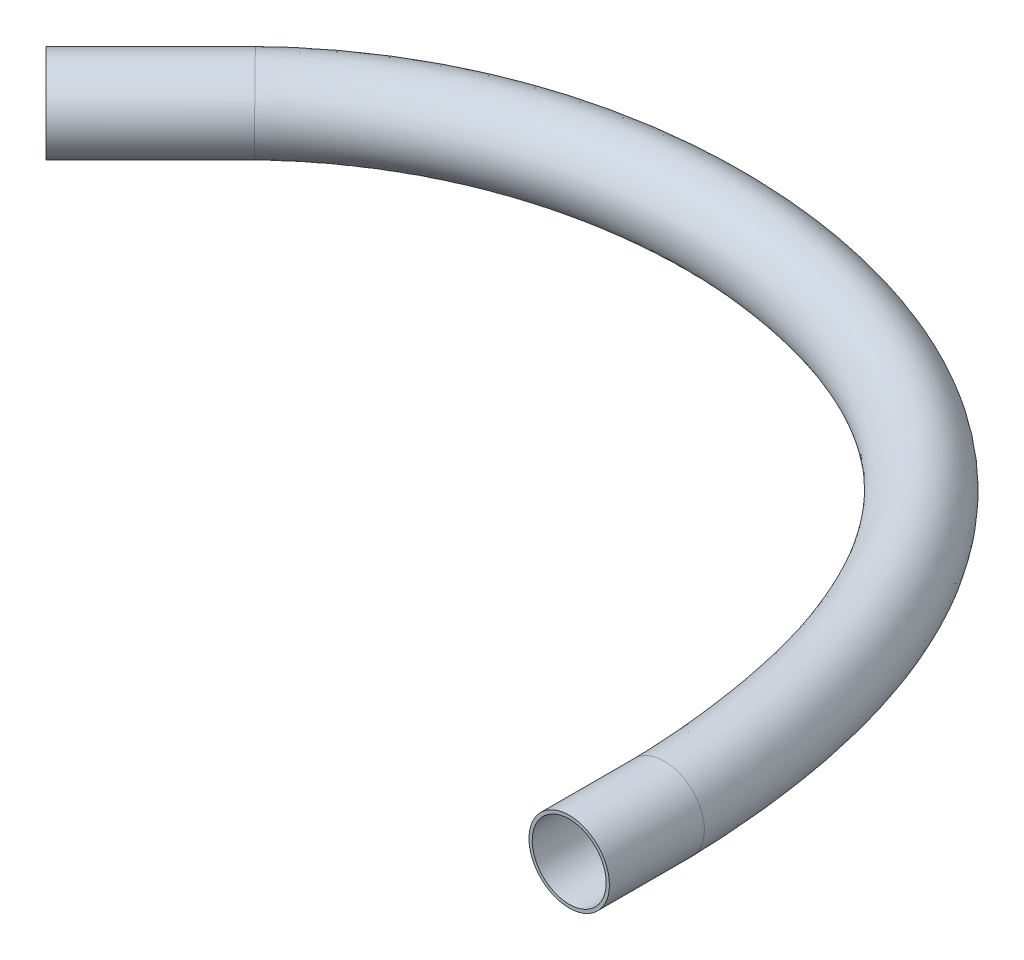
ISO-10303-21;
HEADER;
FILE_DESCRIPTION(('STEP AP214'),'2;1');
FILE_NAME('part.step','',(''),(''),'','','');
FILE_SCHEMA(('AUTOMOTIVE_DESIGN { 1 0 10303 214 1 1 1 1 }'));
ENDSEC;
DATA;
#1=APPLICATION_CONTEXT('core data for automotive mechanical design processes');
#2=APPLICATION_PROTOCOL_DEFINITION('international standard','automotive_design',2000,#1);
#3=PRODUCT_CONTEXT('',#1,'mechanical');
#4=PRODUCT('Part','Part','',(#3));
#5=PRODUCT_RELATED_PRODUCT_CATEGORY('part','',(#4));
#6=PRODUCT_DEFINITION_FORMATION('','',#4);
#7=PRODUCT_DEFINITION_CONTEXT('part definition',#1,'design');
#8=PRODUCT_DEFINITION('design','',#6,#7);
#9=PRODUCT_DEFINITION_SHAPE('','',#8);
#10=(LENGTH_UNIT() NAMED_UNIT(*) SI_UNIT(.MILLI.,.METRE.));
#11=(NAMED_UNIT(*) PLANE_ANGLE_UNIT() SI_UNIT($,.RADIAN.));
#12=(NAMED_UNIT(*) SI_UNIT($,.STERADIAN.) SOLID_ANGLE_UNIT());
#13=UNCERTAINTY_MEASURE_WITH_UNIT(LENGTH_MEASURE(1.E-05),#10,'distance_accuracy_value','');
#14=(GEOMETRIC_REPRESENTATION_CONTEXT(3) GLOBAL_UNCERTAINTY_ASSIGNED_CONTEXT((#13)) GLOBAL_UNIT_ASSIGNED_CONTEXT((#10,
#11,#12)) REPRESENTATION_CONTEXT('',''));
#15=CARTESIAN_POINT('',(0.,0.,0.));
#16=DIRECTION('',(0.,0.,1.));
#17=DIRECTION('',(1.,0.,0.));
#18=AXIS2_PLACEMENT_3D('',#15,#16,#17);
#19=CARTESIAN_POINT('',(-439.764913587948,0.,-270.465086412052));
#20=DIRECTION('',(-0.707106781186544,0.,0.707106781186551));
#21=DIRECTION('',(0.707106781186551,0.,0.707106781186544));
#22=AXIS2_PLACEMENT_3D('',#19,#20,#21);
#23=CYLINDRICAL_SURFACE('',#22,21.75);
#24=CARTESIAN_POINT('',(-439.999999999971,21.75,-270.22999999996));
#25=CARTESIAN_POINT('',(-440.049383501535,21.7500006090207,-270.280352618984));
#26=CARTESIAN_POINT('',(-440.098770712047,21.7496574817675,-270.330709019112));
#27=CARTESIAN_POINT('',(-440.575503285,21.7430293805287,-270.816797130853));
#28=CARTESIAN_POINT('',(-441.0029038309,21.7113680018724,-271.252585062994));
#29=CARTESIAN_POINT('',(-441.641378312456,21.6254810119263,-271.903589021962));
#30=CARTESIAN_POINT('',(-441.853848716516,21.5904314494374,-272.120228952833));
#31=CARTESIAN_POINT('',(-442.277623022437,21.5075808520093,-272.552319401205));
#32=CARTESIAN_POINT('',(-442.488926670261,21.4597771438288,-272.767769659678));
#33=CARTESIAN_POINT('',(-443.121388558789,21.2971089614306,-273.412642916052));
#34=CARTESIAN_POINT('',(-443.540204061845,21.1631076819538,-273.839677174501));
#35=CARTESIAN_POINT('',(-444.368431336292,20.8451070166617,-274.684157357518));
#36=CARTESIAN_POINT('',(-444.777842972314,20.6611069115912,-275.101603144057));
#37=CARTESIAN_POINT('',(-445.382437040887,20.3487658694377,-275.718061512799));
#38=CARTESIAN_POINT('',(-445.58231006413,20.2386421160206,-275.921856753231));
#39=CARTESIAN_POINT('',(-445.978574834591,20.006488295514,-276.325897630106));
#40=CARTESIAN_POINT('',(-446.174967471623,19.8844613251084,-276.526144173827));
#41=CARTESIAN_POINT('',(-446.758526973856,19.5007569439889,-277.121155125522));
#42=CARTESIAN_POINT('',(-447.140095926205,19.2214454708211,-277.510211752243));
#43=CARTESIAN_POINT('',(-447.885095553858,18.6181288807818,-278.269830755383));
#44=CARTESIAN_POINT('',(-448.248538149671,18.2941536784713,-278.640405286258));
#45=CARTESIAN_POINT('',(-448.95503723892,17.6036347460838,-279.360768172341));
#46=CARTESIAN_POINT('',(-449.298093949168,17.2370914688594,-279.710556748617));
#47=CARTESIAN_POINT('',(-449.96145037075,16.4639541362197,-280.386930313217));
#48=CARTESIAN_POINT('',(-450.281744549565,16.0573504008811,-280.713509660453));
#49=CARTESIAN_POINT('',(-450.897212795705,15.2070526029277,-281.341055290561));
#50=CARTESIAN_POINT('',(-451.192386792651,14.7633584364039,-281.642021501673));
#51=CARTESIAN_POINT('',(-451.755550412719,13.841975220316,-282.216236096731));
#52=CARTESIAN_POINT('',(-452.023536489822,13.3642817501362,-282.48948086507));
#53=CARTESIAN_POINT('',(-452.530374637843,12.3783477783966,-283.00626469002));
#54=CARTESIAN_POINT('',(-452.769226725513,11.8701072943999,-283.249803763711));
#55=CARTESIAN_POINT('',(-453.216075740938,10.82674527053,-283.705421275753));
#56=CARTESIAN_POINT('',(-453.424075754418,10.2916264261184,-283.917502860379));
#57=CARTESIAN_POINT('',(-453.807770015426,9.19826519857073,-284.308726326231));
#58=CARTESIAN_POINT('',(-453.983464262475,8.64002281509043,-284.487868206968));
#59=CARTESIAN_POINT('',(-454.301294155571,7.50439536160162,-284.811934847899));
#60=CARTESIAN_POINT('',(-454.443430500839,6.92701069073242,-284.956860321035));
#61=CARTESIAN_POINT('',(-454.693138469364,5.75719266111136,-285.211468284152));
#62=CARTESIAN_POINT('',(-454.800710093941,5.16475930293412,-285.321150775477));
#63=CARTESIAN_POINT('',(-454.980520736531,3.96907497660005,-285.504489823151));
#64=CARTESIAN_POINT('',(-455.052760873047,3.36582435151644,-285.57814751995));
#65=CARTESIAN_POINT('',(-455.161399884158,2.15277609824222,-285.688918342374));
#66=CARTESIAN_POINT('',(-455.197798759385,1.542978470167,-285.726031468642));
#67=CARTESIAN_POINT('',(-455.234496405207,0.321171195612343,-285.763449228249));
#68=CARTESIAN_POINT('',(-455.234795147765,-0.290838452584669,-285.763753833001));
#69=CARTESIAN_POINT('',(-455.199290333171,-1.51271808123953,-285.727552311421));
#70=CARTESIAN_POINT('',(-455.163486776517,-2.12258806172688,-285.691046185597));
#71=CARTESIAN_POINT('',(-455.056033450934,-3.33583588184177,-285.581484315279));
#72=CARTESIAN_POINT('',(-454.984384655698,-3.93921389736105,-285.508429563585));
#73=CARTESIAN_POINT('',(-454.805750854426,-5.13520508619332,-285.326290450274));
#74=CARTESIAN_POINT('',(-454.698765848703,-5.72781825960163,-285.217206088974));
#75=CARTESIAN_POINT('',(-454.450218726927,-6.89807473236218,-284.963781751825));
#76=CARTESIAN_POINT('',(-454.308656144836,-7.47571782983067,-284.819441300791));
#77=CARTESIAN_POINT('',(-453.991961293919,-8.6119193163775,-284.496531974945));
#78=CARTESIAN_POINT('',(-453.816829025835,-9.17047770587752,-284.31796310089));
#79=CARTESIAN_POINT('',(-453.43423051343,-10.264566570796,-283.927856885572));
#80=CARTESIAN_POINT('',(-453.226762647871,-10.8000958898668,-283.716317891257));
#81=CARTESIAN_POINT('',(-452.780974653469,-11.8442897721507,-283.26178222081));
#82=CARTESIAN_POINT('',(-452.542654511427,-12.3529543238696,-283.018785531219));
#83=CARTESIAN_POINT('',(-452.036879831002,-13.3397568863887,-282.503086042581));
#84=CARTESIAN_POINT('',(-451.769427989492,-13.8178977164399,-282.230385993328));
#85=CARTESIAN_POINT('',(-451.20727512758,-14.7403039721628,-281.657201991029));
#86=CARTESIAN_POINT('',(-450.912574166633,-15.1845694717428,-281.356718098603));
#87=CARTESIAN_POINT('',(-450.298048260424,-16.0360233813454,-280.730133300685));
#88=CARTESIAN_POINT('',(-449.978226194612,-16.4432160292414,-280.404035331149));
#89=CARTESIAN_POINT('',(-449.315715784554,-17.2176792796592,-279.728524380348));
#90=CARTESIAN_POINT('',(-448.973027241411,-17.5849495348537,-279.379111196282));
#91=CARTESIAN_POINT('',(-448.266982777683,-18.2771731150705,-278.659211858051));
#92=CARTESIAN_POINT('',(-447.903616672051,-18.6021053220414,-278.288715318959));
#93=CARTESIAN_POINT('',(-447.345288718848,-19.0557507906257,-277.719431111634));
#94=CARTESIAN_POINT('',(-447.156960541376,-19.2013442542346,-277.527407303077));
#95=CARTESIAN_POINT('',(-446.776124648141,-19.4811029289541,-277.139098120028));
#96=CARTESIAN_POINT('',(-446.583615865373,-19.6152651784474,-276.942811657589));
#97=CARTESIAN_POINT('',(-446.000148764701,-20.0003370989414,-276.347894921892));
#98=CARTESIAN_POINT('',(-445.603429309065,-20.233686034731,-275.943390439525));
#99=CARTESIAN_POINT('',(-444.797625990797,-20.6517558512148,-275.121774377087));
#100=CARTESIAN_POINT('',(-444.388542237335,-20.8364771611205,-274.704662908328));
#101=CARTESIAN_POINT('',(-443.768274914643,-21.0759597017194,-274.072223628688));
#102=CARTESIAN_POINT('',(-443.560569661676,-21.1494797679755,-273.860442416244));
#103=CARTESIAN_POINT('',(-443.143229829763,-21.2839462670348,-273.434912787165));
#104=CARTESIAN_POINT('',(-442.933595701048,-21.34489556,-273.2211648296));
#105=CARTESIAN_POINT('',(-442.30244503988,-21.5086838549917,-272.577628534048));
#106=CARTESIAN_POINT('',(-441.878404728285,-21.5925695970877,-272.145266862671));
#107=CARTESIAN_POINT('',(-441.235893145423,-21.6805067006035,-271.490146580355));
#108=CARTESIAN_POINT('',(-441.018582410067,-21.7035350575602,-271.268571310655));
#109=CARTESIAN_POINT('',(-440.583574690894,-21.7362502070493,-270.825026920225));
#110=CARTESIAN_POINT('',(-440.365878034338,-21.7459453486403,-270.603058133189));
#111=CARTESIAN_POINT('',(-440.098772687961,-21.7496571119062,-270.330711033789));
#112=CARTESIAN_POINT('',(-440.049385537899,-21.750000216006,-270.280354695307));
#113=CARTESIAN_POINT('',(-440.000000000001,-21.75,-270.229999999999));
#114=B_SPLINE_CURVE_WITH_KNOTS('',3,(#24,#25,#26,#27,#28,#29,#30,#31,#32,#33,#34,#35,#36,#37,
#38,#39,#40,#41,#42,#43,#44,#45,#46,#47,#48,#49,#50,#51,#52,#53,#54,#55,#56,#57,#58,#59,#60,#61,
#62,#63,#64,#65,#66,#67,#68,#69,#70,#71,#72,#73,#74,#75,#76,#77,#78,#79,#80,#81,#82,#83,#84,#85,
#86,#87,#88,#89,#90,#91,#92,#93,#94,#95,#96,#97,#98,#99,#100,#101,#102,#103,#104,#105,#106,#107,
#108,#109,#110,#111,#112,#113),.UNSPECIFIED.,.F.,.F.,(4,2,2,2,2,2,2,2,2,2,2,2,2,2,2,2,2,2,2,2,2,
2,2,2,2,2,2,2,2,2,2,2,2,2,2,2,2,2,2,2,2,2,2,2,4),(0.,0.211596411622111,2.04249996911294,
2.95867488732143,3.87504198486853,5.71160951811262,7.54820347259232,8.46583191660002,
9.38322226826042,11.2179098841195,13.0513745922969,14.8848197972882,16.7187091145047,
18.5526035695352,20.3867369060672,22.2208691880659,24.0548179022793,25.888766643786,
27.7226771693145,29.5565876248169,31.3904400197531,33.2242923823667,35.0581461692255,
36.8919999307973,38.7258038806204,40.5596078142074,42.393436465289,44.2272650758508,
46.0611856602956,47.8951070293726,49.728858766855,51.5626065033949,53.3961443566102,
55.2296981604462,57.0641630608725,57.9814494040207,58.8989726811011,60.7349016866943,
62.5708144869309,63.4874039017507,64.4037845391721,66.2353267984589,67.1687397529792,
68.1015679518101,68.3131643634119),.UNSPECIFIED.);
#115=CARTESIAN_POINT('',(-440.000000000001,-21.75,-270.229999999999));
#116=VERTEX_POINT('',#115);
#117=CARTESIAN_POINT('',(-439.999999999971,21.75,-270.22999999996));
#118=VERTEX_POINT('',#117);
#119=EDGE_CURVE('E80',#116,#118,#114,.F.);
#120=ORIENTED_EDGE('',*,*,#119,.F.);
#121=CARTESIAN_POINT('',(-439.999999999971,21.75,-270.22999999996));
#122=CARTESIAN_POINT('',(-439.950616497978,21.7500006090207,-270.179647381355));
#123=CARTESIAN_POINT('',(-439.901229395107,21.7496574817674,-270.12929087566));
#124=CARTESIAN_POINT('',(-439.4244977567,21.7430293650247,-269.643199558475));
#125=CARTESIAN_POINT('',(-438.997105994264,21.7113678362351,-269.207400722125));
#126=CARTESIAN_POINT('',(-438.358656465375,21.6254804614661,-268.556368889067));
#127=CARTESIAN_POINT('',(-438.146196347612,21.5904307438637,-268.339717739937));
#128=CARTESIAN_POINT('',(-437.722446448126,21.5075797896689,-267.907601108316));
#129=CARTESIAN_POINT('',(-437.511156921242,21.4597758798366,-267.692135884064));
#130=CARTESIAN_POINT('',(-436.878743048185,21.2971070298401,-267.047212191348));
#131=CARTESIAN_POINT('',(-436.459967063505,21.163105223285,-266.620136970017));
#132=CARTESIAN_POINT('',(-435.631832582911,20.8451033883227,-265.775561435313));
#133=CARTESIAN_POINT('',(-435.222474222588,20.6611026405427,-265.358061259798));
#134=CARTESIAN_POINT('',(-434.617969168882,20.3487605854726,-264.741512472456));
#135=CARTESIAN_POINT('',(-434.41812733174,20.2386364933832,-264.537685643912));
#136=CARTESIAN_POINT('',(-434.021927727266,20.0064819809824,-264.133578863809));
#137=CARTESIAN_POINT('',(-433.825569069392,19.8844546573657,-263.93329800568));
#138=CARTESIAN_POINT('',(-433.242115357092,19.5007491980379,-263.33818034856));
#139=CARTESIAN_POINT('',(-432.86062207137,19.2214369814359,-262.94904756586));
#140=CARTESIAN_POINT('',(-432.115781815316,18.618118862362,-262.189268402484));
#141=CARTESIAN_POINT('',(-431.752422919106,18.2941428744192,-261.81860987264));
#142=CARTESIAN_POINT('',(-431.046096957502,17.6036223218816,-261.098073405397));
#143=CARTESIAN_POINT('',(-430.703129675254,17.2370782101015,-260.748195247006));
#144=CARTESIAN_POINT('',(-430.039954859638,16.4639385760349,-260.071638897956));
#145=CARTESIAN_POINT('',(-429.719752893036,16.0573333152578,-259.744966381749));
#146=CARTESIAN_POINT('',(-429.104469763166,15.2070322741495,-259.117233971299));
#147=CARTESIAN_POINT('',(-428.809388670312,14.7633363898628,-258.816174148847));
#148=CARTESIAN_POINT('',(-428.246408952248,13.8419495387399,-258.241774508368));
#149=CARTESIAN_POINT('',(-427.978513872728,13.3642541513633,-257.96843830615));
#150=CARTESIAN_POINT('',(-427.471853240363,12.3783161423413,-257.45147639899));
#151=CARTESIAN_POINT('',(-427.233087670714,11.8700735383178,-257.207850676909));
#152=CARTESIAN_POINT('',(-426.786405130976,10.8267079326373,-256.752067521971));
#153=CARTESIAN_POINT('',(-426.578485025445,10.2915876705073,-256.539906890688));
#154=CARTESIAN_POINT('',(-426.194941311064,9.1982235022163,-256.148534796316));
#155=CARTESIAN_POINT('',(-426.019317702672,8.63997959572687,-255.969323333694));
#156=CARTESIAN_POINT('',(-425.701617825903,7.50434901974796,-255.645129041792));
#157=CARTESIAN_POINT('',(-425.559540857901,6.92696274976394,-255.500145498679));
#158=CARTESIAN_POINT('',(-425.309938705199,5.75714146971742,-255.245434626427));
#159=CARTESIAN_POINT('',(-425.202413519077,5.16470646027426,-255.135707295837));
#160=CARTESIAN_POINT('',(-425.022681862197,3.96902119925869,-254.952293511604));
#161=CARTESIAN_POINT('',(-424.950474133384,3.36577133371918,-254.878605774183));
#162=CARTESIAN_POINT('',(-424.841884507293,2.15272469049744,-254.767790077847));
#163=CARTESIAN_POINT('',(-424.805502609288,1.54292791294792,-254.73066211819));
#164=CARTESIAN_POINT('',(-424.768823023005,0.321122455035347,-254.693230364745));
#165=CARTESIAN_POINT('',(-424.768525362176,-0.290886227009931,-254.692926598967));
#166=CARTESIAN_POINT('',(-424.804016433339,-1.5127638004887,-254.729145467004));
#167=CARTESIAN_POINT('',(-424.839805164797,-2.12263269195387,-254.765668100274));
#168=CARTESIAN_POINT('',(-424.947213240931,-3.33587665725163,-254.875278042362));
#169=CARTESIAN_POINT('',(-425.018831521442,-3.93925192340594,-254.948364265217));
#170=CARTESIAN_POINT('',(-425.197389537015,-5.13523753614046,-255.13058041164));
#171=CARTESIAN_POINT('',(-425.304329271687,-5.72784788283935,-255.239710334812));
#172=CARTESIAN_POINT('',(-425.552772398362,-6.89809866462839,-255.493238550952));
#173=CARTESIAN_POINT('',(-425.694276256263,-7.47573889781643,-255.637637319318));
#174=CARTESIAN_POINT('',(-426.01084188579,-8.6119346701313,-255.960674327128));
#175=CARTESIAN_POINT('',(-426.185903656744,-9.17049020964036,-256.139312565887));
#176=CARTESIAN_POINT('',(-426.568351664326,-10.2645742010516,-256.529566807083));
#177=CARTESIAN_POINT('',(-426.775739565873,-10.8001014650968,-256.741184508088));
#178=CARTESIAN_POINT('',(-427.221360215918,-11.8442913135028,-257.195884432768));
#179=CARTESIAN_POINT('',(-427.459592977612,-12.3529538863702,-257.438966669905));
#180=CARTESIAN_POINT('',(-427.965187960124,-13.3397526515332,-257.954841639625));
#181=CARTESIAN_POINT('',(-428.232547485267,-13.817891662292,-258.227631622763));
#182=CARTESIAN_POINT('',(-428.79451335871,-14.7402945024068,-258.800997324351));
#183=CARTESIAN_POINT('',(-429.089119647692,-15.1845584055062,-259.101572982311));
#184=CARTESIAN_POINT('',(-429.703458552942,-16.0360122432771,-259.728342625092));
#185=CARTESIAN_POINT('',(-430.023188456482,-16.4432061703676,-260.054533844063));
#186=CARTESIAN_POINT('',(-430.685517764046,-17.2176717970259,-260.730228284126));
#187=CARTESIAN_POINT('',(-431.028117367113,-17.5849431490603,-261.079731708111));
#188=CARTESIAN_POINT('',(-431.733989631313,-18.2771687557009,-261.79980608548));
#189=CARTESIAN_POINT('',(-432.09727248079,-18.6021018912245,-262.170387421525));
#190=CARTESIAN_POINT('',(-432.655481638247,-19.055748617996,-262.739792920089));
#191=CARTESIAN_POINT('',(-432.843771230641,-19.2013424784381,-262.931856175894));
#192=CARTESIAN_POINT('',(-433.224532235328,-19.4811019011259,-263.32024203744));
#193=CARTESIAN_POINT('',(-433.41700471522,-19.6152645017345,-263.516565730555));
#194=CARTESIAN_POINT('',(-434.000366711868,-20.0003374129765,-264.111590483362));
#195=CARTESIAN_POINT('',(-434.397021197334,-20.2336869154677,-264.516162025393));
#196=CARTESIAN_POINT('',(-435.202706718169,-20.6517576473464,-265.337900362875));
#197=CARTESIAN_POINT('',(-435.611737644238,-20.8364793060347,-265.755067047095));
#198=CARTESIAN_POINT('',(-436.231936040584,-21.0759621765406,-266.387579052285));
#199=CARTESIAN_POINT('',(-436.439620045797,-21.1494823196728,-266.599382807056));
#200=CARTESIAN_POINT('',(-436.856920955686,-21.283948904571,-267.024954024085));
#201=CARTESIAN_POINT('',(-437.066537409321,-21.3448982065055,-267.23872102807));
#202=CARTESIAN_POINT('',(-437.697640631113,-21.5086864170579,-267.882308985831));
#203=CARTESIAN_POINT('',(-438.121656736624,-21.5925719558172,-268.314697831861));
#204=CARTESIAN_POINT('',(-438.764140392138,-21.6805080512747,-268.969844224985));
#205=CARTESIAN_POINT('',(-438.981441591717,-21.7035359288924,-269.191424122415));
#206=CARTESIAN_POINT('',(-439.416434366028,-21.7362504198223,-269.634973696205));
#207=CARTESIAN_POINT('',(-439.634125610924,-21.7459453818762,-269.856943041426));
#208=CARTESIAN_POINT('',(-439.901227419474,-21.7496571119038,-270.129288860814));
#209=CARTESIAN_POINT('',(-439.950614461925,-21.7500002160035,-270.179645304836));
#210=CARTESIAN_POINT('',(-440.000000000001,-21.75,-270.229999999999));
#211=B_SPLINE_CURVE_WITH_KNOTS('',3,(#121,#122,#123,#124,#125,#126,#127,#128,#129,#130,#131,
#132,#133,#134,#135,#136,#137,#138,#139,#140,#141,#142,#143,#144,#145,#146,#147,#148,#149,#150,
#151,#152,#153,#154,#155,#156,#157,#158,#159,#160,#161,#162,#163,#164,#165,#166,#167,#168,#169,
#170,#171,#172,#173,#174,#175,#176,#177,#178,#179,#180,#181,#182,#183,#184,#185,#186,#187,#188,
#189,#190,#191,#192,#193,#194,#195,#196,#197,#198,#199,#200,#201,#202,#203,#204,#205,#206,#207,
#208,#209,#210),.UNSPECIFIED.,.F.,.F.,(4,2,2,2,2,2,2,2,2,2,2,2,2,2,2,2,2,2,2,2,2,2,2,2,2,2,2,2,
2,2,2,2,2,2,2,2,2,2,2,2,2,2,2,2,4),(0.,0.211596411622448,2.0425048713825,2.95868224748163,
3.87505180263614,5.71162429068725,7.5482232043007,8.46585402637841,9.38324675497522,
11.2179391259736,13.0514085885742,14.8848585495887,16.7187553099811,18.5526572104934,
20.3867979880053,22.2209377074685,24.0548908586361,25.888844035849,27.7227589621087,
29.5566738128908,31.3905233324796,33.2243728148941,35.0582236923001,36.8920745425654,
38.7258709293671,40.5596672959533,42.3934883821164,44.2273094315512,46.0612249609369,
47.8951412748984,49.7288880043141,51.5626307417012,53.3961757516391,55.2297367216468,
57.0642088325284,57.981498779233,58.8990256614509,60.7349619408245,62.5708820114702,
63.4874750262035,64.4038592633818,66.2354087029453,67.1688114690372,68.1016294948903,
68.3132259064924),.UNSPECIFIED.);
#212=EDGE_CURVE('E40',#116,#118,#211,.F.);
#213=ORIENTED_EDGE('',*,*,#212,.T.);
#214=EDGE_LOOP('',(#120,#213));
#215=FACE_BOUND('',#214,.T.);
#216=CARTESIAN_POINT('',(-496.568542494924,0.,-213.661457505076));
#217=DIRECTION('',(0.707106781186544,0.,-0.707106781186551));
#218=DIRECTION('',(-0.707106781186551,0.,-0.707106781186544));
#219=AXIS2_PLACEMENT_3D('',#216,#217,#218);
#220=CIRCLE('',#219,21.75);
#221=CARTESIAN_POINT('',(-511.948114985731,0.,-229.041029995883));
#222=VERTEX_POINT('',#221);
#223=EDGE_CURVE('E55',#222,#222,#220,.T.);
#224=ORIENTED_EDGE('',*,*,#223,.T.);
#225=EDGE_LOOP('',(#224));
#226=FACE_BOUND('',#225,.T.);
#227=ADVANCED_FACE('F37',(#215,#226),#23,.T.);
#228=CARTESIAN_POINT('',(21.754454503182,0.,-51.2214302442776));
#229=CARTESIAN_POINT('',(21.749062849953,0.,-51.3855983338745));
#230=CARTESIAN_POINT('',(21.7437739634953,0.,-51.5466395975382));
#231=CARTESIAN_POINT('',(21.6998332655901,0.,-52.8845524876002));
#232=CARTESIAN_POINT('',(21.6564609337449,0.,-54.0954360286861));
#233=CARTESIAN_POINT('',(21.5641835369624,0.,-56.4664636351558));
#234=CARTESIAN_POINT('',(21.514560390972,0.,-57.6484881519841));
#235=CARTESIAN_POINT('',(21.3552537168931,0.,-61.1841117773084));
#236=CARTESIAN_POINT('',(21.2351330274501,0.,-63.5272610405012));
#237=CARTESIAN_POINT('',(20.8331483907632,0.,-70.5150500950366));
#238=CARTESIAN_POINT('',(20.5096630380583,0.,-75.1180326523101));
#239=CARTESIAN_POINT('',(19.3736868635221,0.,-88.7614261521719));
#240=CARTESIAN_POINT('',(18.3956921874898,0.,-97.6363147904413));
#241=CARTESIAN_POINT('',(14.8067757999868,0.,-123.606481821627));
#242=CARTESIAN_POINT('',(11.5409942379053,0.,-140.048048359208));
#243=CARTESIAN_POINT('',(-0.825590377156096,0.,-186.79534463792));
#244=CARTESIAN_POINT('',(-12.5093831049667,0.,-214.539859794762));
#245=CARTESIAN_POINT('',(-42.361620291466,0.,-263.041670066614));
#246=CARTESIAN_POINT('',(-60.5401382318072,0.,-283.771313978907));
#247=CARTESIAN_POINT('',(-102.376859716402,0.,-317.897611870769));
#248=CARTESIAN_POINT('',(-126.002623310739,0.,-331.283062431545));
#249=CARTESIAN_POINT('',(-175.083845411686,0.,-350.133587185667));
#250=CARTESIAN_POINT('',(-200.252254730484,0.,-356.263993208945));
#251=CARTESIAN_POINT('',(-252.262177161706,0.,-362.116829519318));
#252=CARTESIAN_POINT('',(-279.109371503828,0.,-361.836431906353));
#253=CARTESIAN_POINT('',(-332.501547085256,0.,-353.920801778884));
#254=CARTESIAN_POINT('',(-359.053320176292,0.,-346.277581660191));
#255=CARTESIAN_POINT('',(-396.97774408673,0.,-328.515352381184));
#256=CARTESIAN_POINT('',(-409.298994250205,0.,-321.545071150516));
#257=CARTESIAN_POINT('',(-427.064662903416,0.,-309.43525325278));
#258=CARTESIAN_POINT('',(-432.867025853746,0.,-305.123119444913));
#259=CARTESIAN_POINT('',(-441.360920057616,0.,-298.233841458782));
#260=CARTESIAN_POINT('',(-444.157273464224,0.,-295.867253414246));
#261=CARTESIAN_POINT('',(-448.295588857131,0.,-292.211315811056));
#262=CARTESIAN_POINT('',(-449.665658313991,0.,-290.974995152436));
#263=CARTESIAN_POINT('',(-451.706236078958,0.,-289.093910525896));
#264=CARTESIAN_POINT('',(-452.384007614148,0.,-288.46244844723));
#265=CARTESIAN_POINT('',(-453.39697440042,0.,-287.50859371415));
#266=CARTESIAN_POINT('',(-453.73401491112,0.,-287.189531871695));
#267=CARTESIAN_POINT('',(-454.406855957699,0.,-286.549185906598));
#268=CARTESIAN_POINT('',(-454.756527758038,0.,-286.214558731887));
#269=CARTESIAN_POINT('',(-455.161305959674,0.,-285.825214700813));
#270=CARTESIAN_POINT('',(-455.237572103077,0.,-285.751856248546));
#271=CARTESIAN_POINT('',(-455.3174420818,0.,-285.67503154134));
#272=CARTESIAN_POINT('',(21.754454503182,43.5,-51.2214302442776));
#273=CARTESIAN_POINT('',(21.749062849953,43.5,-51.3855983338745));
#274=CARTESIAN_POINT('',(21.7437739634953,43.5,-51.5466395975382));
#275=CARTESIAN_POINT('',(21.6998332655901,43.5,-52.8845524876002));
#276=CARTESIAN_POINT('',(21.6564609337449,43.5,-54.0954360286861));
#277=CARTESIAN_POINT('',(21.5641835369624,43.5,-56.4664636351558));
#278=CARTESIAN_POINT('',(21.514560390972,43.5,-57.6484881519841));
#279=CARTESIAN_POINT('',(21.3552537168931,43.5,-61.1841117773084));
#280=CARTESIAN_POINT('',(21.2351330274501,43.5,-63.5272610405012));
#281=CARTESIAN_POINT('',(20.8331483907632,43.5,-70.5150500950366));
#282=CARTESIAN_POINT('',(20.5096630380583,43.5,-75.1180326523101));
#283=CARTESIAN_POINT('',(19.3736868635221,43.5,-88.7614261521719));
#284=CARTESIAN_POINT('',(18.3956921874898,43.5,-97.6363147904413));
#285=CARTESIAN_POINT('',(14.8067757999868,43.5,-123.606481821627));
#286=CARTESIAN_POINT('',(11.5409942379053,43.5,-140.048048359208));
#287=CARTESIAN_POINT('',(-0.825590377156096,43.5,-186.79534463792));
#288=CARTESIAN_POINT('',(-12.5093831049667,43.5,-214.539859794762));
#289=CARTESIAN_POINT('',(-42.361620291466,43.5,-263.041670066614));
#290=CARTESIAN_POINT('',(-60.5401382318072,43.5,-283.771313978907));
#291=CARTESIAN_POINT('',(-102.376859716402,43.5,-317.897611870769));
#292=CARTESIAN_POINT('',(-126.002623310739,43.5,-331.283062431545));
#293=CARTESIAN_POINT('',(-175.083845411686,43.5,-350.133587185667));
#294=CARTESIAN_POINT('',(-200.252254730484,43.5,-356.263993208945));
#295=CARTESIAN_POINT('',(-252.262177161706,43.5,-362.116829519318));
#296=CARTESIAN_POINT('',(-279.109371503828,43.5,-361.836431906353));
#297=CARTESIAN_POINT('',(-332.501547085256,43.5,-353.920801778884));
#298=CARTESIAN_POINT('',(-359.053320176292,43.5,-346.277581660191));
#299=CARTESIAN_POINT('',(-396.97774408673,43.5,-328.515352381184));
#300=CARTESIAN_POINT('',(-409.298994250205,43.5,-321.545071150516));
#301=CARTESIAN_POINT('',(-427.064662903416,43.5,-309.43525325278));
#302=CARTESIAN_POINT('',(-432.867025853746,43.5,-305.123119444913));
#303=CARTESIAN_POINT('',(-441.360920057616,43.5,-298.233841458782));
#304=CARTESIAN_POINT('',(-444.157273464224,43.5,-295.867253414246));
#305=CARTESIAN_POINT('',(-448.295588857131,43.5,-292.211315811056));
#306=CARTESIAN_POINT('',(-449.665658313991,43.5,-290.974995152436));
#307=CARTESIAN_POINT('',(-451.706236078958,43.5,-289.093910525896));
#308=CARTESIAN_POINT('',(-452.384007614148,43.5,-288.46244844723));
#309=CARTESIAN_POINT('',(-453.39697440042,43.5,-287.50859371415));
#310=CARTESIAN_POINT('',(-453.73401491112,43.5,-287.189531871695));
#311=CARTESIAN_POINT('',(-454.406855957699,43.5,-286.549185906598));
#312=CARTESIAN_POINT('',(-454.756527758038,43.5,-286.214558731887));
#313=CARTESIAN_POINT('',(-455.161305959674,43.5,-285.825214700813));
#314=CARTESIAN_POINT('',(-455.237572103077,43.5,-285.751856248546));
#315=CARTESIAN_POINT('',(-455.3174420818,43.5,-285.67503154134));
#316=CARTESIAN_POINT('',(-21.7221045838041,43.5,-49.7935612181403));
#317=CARTESIAN_POINT('',(-21.7274962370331,43.5,-49.9577293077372));
#318=CARTESIAN_POINT('',(-21.7329905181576,43.5,-50.1250243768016));
#319=CARTESIAN_POINT('',(-21.7752886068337,43.5,-51.4129235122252));
#320=CARTESIAN_POINT('',(-21.814071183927,43.5,-52.4921093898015));
#321=CARTESIAN_POINT('',(-21.8994710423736,43.5,-54.686421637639));
#322=CARTESIAN_POINT('',(-21.9453692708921,43.5,-55.7796686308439));
#323=CARTESIAN_POINT('',(-22.0926186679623,43.5,-59.0476952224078));
#324=CARTESIAN_POINT('',(-22.2035246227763,43.5,-61.2107603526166));
#325=CARTESIAN_POINT('',(-22.574137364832,43.5,-67.6532047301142));
#326=CARTESIAN_POINT('',(-22.8717401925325,43.5,-71.8858314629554));
#327=CARTESIAN_POINT('',(-23.9134955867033,43.5,-84.3976068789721));
#328=CARTESIAN_POINT('',(-24.8066113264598,43.5,-92.4906189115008));
#329=CARTESIAN_POINT('',(-28.0600722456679,43.5,-116.033358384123));
#330=CARTESIAN_POINT('',(-30.9946036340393,43.5,-130.746002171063));
#331=CARTESIAN_POINT('',(-41.9145657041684,43.5,-172.024877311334));
#332=CARTESIAN_POINT('',(-52.0026145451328,43.5,-195.715863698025));
#333=CARTESIAN_POINT('',(-76.9592739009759,43.5,-236.263684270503));
#334=CARTESIAN_POINT('',(-91.8178109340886,43.5,-253.148169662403));
#335=CARTESIAN_POINT('',(-126.090671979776,43.5,-281.104611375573));
#336=CARTESIAN_POINT('',(-145.537435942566,43.5,-292.187771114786));
#337=CARTESIAN_POINT('',(-187.098882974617,43.5,-308.150191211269));
#338=CARTESIAN_POINT('',(-208.737801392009,43.5,-313.444329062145));
#339=CARTESIAN_POINT('',(-253.505599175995,43.5,-318.482186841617));
#340=CARTESIAN_POINT('',(-276.628797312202,43.5,-318.228734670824));
#341=CARTESIAN_POINT('',(-322.223432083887,43.5,-311.469125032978));
#342=CARTESIAN_POINT('',(-344.688076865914,43.5,-304.970955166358));
#343=CARTESIAN_POINT('',(-376.485019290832,43.5,-290.078584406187));
#344=CARTESIAN_POINT('',(-386.770347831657,43.5,-284.256913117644));
#345=CARTESIAN_POINT('',(-401.577759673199,43.5,-274.163565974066));
#346=CARTESIAN_POINT('',(-406.410292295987,43.5,-270.572105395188));
#347=CARTESIAN_POINT('',(-413.486298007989,43.5,-264.832856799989));
#348=CARTESIAN_POINT('',(-415.816170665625,43.5,-262.86108015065));
#349=CARTESIAN_POINT('',(-419.265552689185,43.5,-259.813771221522));
#350=CARTESIAN_POINT('',(-420.407775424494,43.5,-258.783059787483));
#351=CARTESIAN_POINT('',(-422.109471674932,43.5,-257.214369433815));
#352=CARTESIAN_POINT('',(-422.674764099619,43.5,-256.687702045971));
#353=CARTESIAN_POINT('',(-423.519757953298,43.5,-255.892018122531));
#354=CARTESIAN_POINT('',(-423.800931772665,43.5,-255.625843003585));
#355=CARTESIAN_POINT('',(-424.362291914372,43.5,-255.091593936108));
#356=CARTESIAN_POINT('',(-424.628606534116,43.5,-254.836862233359));
#357=CARTESIAN_POINT('',(-424.998434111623,43.5,-254.481136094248));
#358=CARTESIAN_POINT('',(-425.081907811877,43.5,-254.40084492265));
#359=CARTESIAN_POINT('',(-425.1617777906,43.5,-254.324020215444));
#360=CARTESIAN_POINT('',(-21.7221045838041,0.,-49.7935612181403));
#361=CARTESIAN_POINT('',(-21.7274962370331,0.,-49.9577293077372));
#362=CARTESIAN_POINT('',(-21.7329905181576,0.,-50.1250243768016));
#363=CARTESIAN_POINT('',(-21.7752886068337,0.,-51.4129235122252));
#364=CARTESIAN_POINT('',(-21.814071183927,0.,-52.4921093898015));
#365=CARTESIAN_POINT('',(-21.8994710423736,0.,-54.686421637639));
#366=CARTESIAN_POINT('',(-21.9453692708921,0.,-55.7796686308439));
#367=CARTESIAN_POINT('',(-22.0926186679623,0.,-59.0476952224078));
#368=CARTESIAN_POINT('',(-22.2035246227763,0.,-61.2107603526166));
#369=CARTESIAN_POINT('',(-22.574137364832,0.,-67.6532047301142));
#370=CARTESIAN_POINT('',(-22.8717401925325,0.,-71.8858314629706));
#371=CARTESIAN_POINT('',(-23.9134955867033,0.,-84.3976068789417));
#372=CARTESIAN_POINT('',(-24.8066113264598,0.,-92.4906189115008));
#373=CARTESIAN_POINT('',(-28.0600722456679,0.,-116.033358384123));
#374=CARTESIAN_POINT('',(-30.9946036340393,0.,-130.746002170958));
#375=CARTESIAN_POINT('',(-41.9145657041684,0.,-172.024877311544));
#376=CARTESIAN_POINT('',(-52.0026145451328,0.,-195.715863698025));
#377=CARTESIAN_POINT('',(-76.9592739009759,0.,-236.263684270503));
#378=CARTESIAN_POINT('',(-91.8178109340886,0.,-253.148169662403));
#379=CARTESIAN_POINT('',(-126.090671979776,0.,-281.104611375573));
#380=CARTESIAN_POINT('',(-145.537435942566,0.,-292.187771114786));
#381=CARTESIAN_POINT('',(-187.098882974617,0.,-308.150191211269));
#382=CARTESIAN_POINT('',(-208.737801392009,0.,-313.444329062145));
#383=CARTESIAN_POINT('',(-253.505599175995,0.,-318.482186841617));
#384=CARTESIAN_POINT('',(-276.628797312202,0.,-318.228734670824));
#385=CARTESIAN_POINT('',(-322.223432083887,0.,-311.469125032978));
#386=CARTESIAN_POINT('',(-344.688076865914,0.,-304.970955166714));
#387=CARTESIAN_POINT('',(-376.485019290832,0.,-290.078584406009));
#388=CARTESIAN_POINT('',(-386.770347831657,0.,-284.256913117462));
#389=CARTESIAN_POINT('',(-401.577759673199,0.,-274.163565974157));
#390=CARTESIAN_POINT('',(-406.410292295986,0.,-270.572105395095));
#391=CARTESIAN_POINT('',(-413.486298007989,0.,-264.832856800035));
#392=CARTESIAN_POINT('',(-415.816170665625,0.,-262.86108015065));
#393=CARTESIAN_POINT('',(-419.265552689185,0.,-259.813771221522));
#394=CARTESIAN_POINT('',(-420.407775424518,0.,-258.783059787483));
#395=CARTESIAN_POINT('',(-422.10947167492,0.,-257.214369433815));
#396=CARTESIAN_POINT('',(-422.674764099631,0.,-256.687702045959));
#397=CARTESIAN_POINT('',(-423.519757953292,0.,-255.892018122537));
#398=CARTESIAN_POINT('',(-423.800931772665,0.,-255.625843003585));
#399=CARTESIAN_POINT('',(-424.362291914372,0.,-255.091593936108));
#400=CARTESIAN_POINT('',(-424.628606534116,0.,-254.836862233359));
#401=CARTESIAN_POINT('',(-424.998434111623,0.,-254.481136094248));
#402=CARTESIAN_POINT('',(-425.081907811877,0.,-254.40084492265));
#403=CARTESIAN_POINT('',(-425.1617777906,0.,-254.324020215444));
#404=CARTESIAN_POINT('',(-21.7221045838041,-43.5,-49.7935612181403));
#405=CARTESIAN_POINT('',(-21.7274962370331,-43.5,-49.9577293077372));
#406=CARTESIAN_POINT('',(-21.7329905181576,-43.5,-50.1250243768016));
#407=CARTESIAN_POINT('',(-21.7752886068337,-43.5,-51.4129235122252));
#408=CARTESIAN_POINT('',(-21.814071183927,-43.5,-52.4921093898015));
#409=CARTESIAN_POINT('',(-21.8994710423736,-43.5,-54.686421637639));
#410=CARTESIAN_POINT('',(-21.9453692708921,-43.5,-55.7796686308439));
#411=CARTESIAN_POINT('',(-22.0926186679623,-43.5,-59.0476952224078));
#412=CARTESIAN_POINT('',(-22.2035246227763,-43.5,-61.2107603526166));
#413=CARTESIAN_POINT('',(-22.574137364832,-43.5,-67.6532047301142));
#414=CARTESIAN_POINT('',(-22.8717401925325,-43.5,-71.8858314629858));
#415=CARTESIAN_POINT('',(-23.9134955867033,-43.5,-84.3976068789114));
#416=CARTESIAN_POINT('',(-24.8066113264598,-43.5,-92.4906189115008));
#417=CARTESIAN_POINT('',(-28.0600722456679,-43.5,-116.033358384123));
#418=CARTESIAN_POINT('',(-30.9946036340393,-43.5,-130.746002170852));
#419=CARTESIAN_POINT('',(-41.9145657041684,-43.5,-172.024877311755));
#420=CARTESIAN_POINT('',(-52.0026145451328,-43.5,-195.715863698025));
#421=CARTESIAN_POINT('',(-76.9592739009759,-43.5,-236.263684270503));
#422=CARTESIAN_POINT('',(-91.8178109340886,-43.5,-253.148169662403));
#423=CARTESIAN_POINT('',(-126.090671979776,-43.5,-281.104611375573));
#424=CARTESIAN_POINT('',(-145.537435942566,-43.5,-292.187771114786));
#425=CARTESIAN_POINT('',(-187.098882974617,-43.5,-308.150191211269));
#426=CARTESIAN_POINT('',(-208.737801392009,-43.5,-313.444329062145));
#427=CARTESIAN_POINT('',(-253.505599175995,-43.5,-318.482186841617));
#428=CARTESIAN_POINT('',(-276.628797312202,-43.5,-318.228734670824));
#429=CARTESIAN_POINT('',(-322.223432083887,-43.5,-311.469125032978));
#430=CARTESIAN_POINT('',(-344.688076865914,-43.5,-304.97095516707));
#431=CARTESIAN_POINT('',(-376.485019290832,-43.5,-290.078584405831));
#432=CARTESIAN_POINT('',(-386.770347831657,-43.5,-284.25691311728));
#433=CARTESIAN_POINT('',(-401.577759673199,-43.5,-274.163565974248));
#434=CARTESIAN_POINT('',(-406.410292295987,-43.5,-270.572105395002));
#435=CARTESIAN_POINT('',(-413.486298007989,-43.5,-264.832856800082));
#436=CARTESIAN_POINT('',(-415.816170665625,-43.5,-262.86108015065));
#437=CARTESIAN_POINT('',(-419.265552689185,-43.5,-259.813771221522));
#438=CARTESIAN_POINT('',(-420.407775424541,-43.5,-258.783059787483));
#439=CARTESIAN_POINT('',(-422.109471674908,-43.5,-257.214369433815));
#440=CARTESIAN_POINT('',(-422.674764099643,-43.5,-256.687702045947));
#441=CARTESIAN_POINT('',(-423.519757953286,-43.5,-255.892018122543));
#442=CARTESIAN_POINT('',(-423.800931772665,-43.5,-255.625843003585));
#443=CARTESIAN_POINT('',(-424.362291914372,-43.5,-255.091593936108));
#444=CARTESIAN_POINT('',(-424.628606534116,-43.5,-254.836862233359));
#445=CARTESIAN_POINT('',(-424.998434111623,-43.5,-254.481136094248));
#446=CARTESIAN_POINT('',(-425.081907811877,-43.5,-254.40084492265));
#447=CARTESIAN_POINT('',(-425.1617777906,-43.5,-254.324020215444));
#448=CARTESIAN_POINT('',(21.754454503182,-43.5,-51.2214302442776));
#449=CARTESIAN_POINT('',(21.749062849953,-43.5,-51.3855983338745));
#450=CARTESIAN_POINT('',(21.7437739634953,-43.5,-51.5466395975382));
#451=CARTESIAN_POINT('',(21.6998332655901,-43.5,-52.8845524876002));
#452=CARTESIAN_POINT('',(21.6564609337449,-43.5,-54.0954360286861));
#453=CARTESIAN_POINT('',(21.5641835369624,-43.5,-56.4664636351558));
#454=CARTESIAN_POINT('',(21.514560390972,-43.5,-57.6484881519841));
#455=CARTESIAN_POINT('',(21.3552537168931,-43.5,-61.1841117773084));
#456=CARTESIAN_POINT('',(21.2351330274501,-43.5,-63.5272610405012));
#457=CARTESIAN_POINT('',(20.8331483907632,-43.5,-70.5150500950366));
#458=CARTESIAN_POINT('',(20.5096630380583,-43.5,-75.1180326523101));
#459=CARTESIAN_POINT('',(19.3736868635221,-43.5,-88.7614261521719));
#460=CARTESIAN_POINT('',(18.3956921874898,-43.5,-97.6363147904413));
#461=CARTESIAN_POINT('',(14.8067757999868,-43.5,-123.606481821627));
#462=CARTESIAN_POINT('',(11.5409942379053,-43.5,-140.048048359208));
#463=CARTESIAN_POINT('',(-0.825590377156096,-43.5,-186.79534463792));
#464=CARTESIAN_POINT('',(-12.5093831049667,-43.5,-214.539859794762));
#465=CARTESIAN_POINT('',(-42.361620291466,-43.5,-263.041670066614));
#466=CARTESIAN_POINT('',(-60.5401382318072,-43.5,-283.771313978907));
#467=CARTESIAN_POINT('',(-102.376859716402,-43.5,-317.897611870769));
#468=CARTESIAN_POINT('',(-126.002623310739,-43.5,-331.283062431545));
#469=CARTESIAN_POINT('',(-175.083845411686,-43.5,-350.133587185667));
#470=CARTESIAN_POINT('',(-200.252254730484,-43.5,-356.263993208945));
#471=CARTESIAN_POINT('',(-252.262177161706,-43.5,-362.116829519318));
#472=CARTESIAN_POINT('',(-279.109371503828,-43.5,-361.836431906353));
#473=CARTESIAN_POINT('',(-332.501547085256,-43.5,-353.920801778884));
#474=CARTESIAN_POINT('',(-359.053320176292,-43.5,-346.277581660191));
#475=CARTESIAN_POINT('',(-396.97774408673,-43.5,-328.515352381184));
#476=CARTESIAN_POINT('',(-409.298994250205,-43.5,-321.545071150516));
#477=CARTESIAN_POINT('',(-427.064662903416,-43.5,-309.43525325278));
#478=CARTESIAN_POINT('',(-432.867025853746,-43.5,-305.123119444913));
#479=CARTESIAN_POINT('',(-441.360920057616,-43.5,-298.233841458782));
#480=CARTESIAN_POINT('',(-444.157273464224,-43.5,-295.867253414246));
#481=CARTESIAN_POINT('',(-448.295588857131,-43.5,-292.211315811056));
#482=CARTESIAN_POINT('',(-449.665658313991,-43.5,-290.974995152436));
#483=CARTESIAN_POINT('',(-451.706236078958,-43.5,-289.093910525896));
#484=CARTESIAN_POINT('',(-452.384007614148,-43.5,-288.46244844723));
#485=CARTESIAN_POINT('',(-453.39697440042,-43.5,-287.50859371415));
#486=CARTESIAN_POINT('',(-453.73401491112,-43.5,-287.189531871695));
#487=CARTESIAN_POINT('',(-454.406855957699,-43.5,-286.549185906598));
#488=CARTESIAN_POINT('',(-454.756527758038,-43.5,-286.214558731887));
#489=CARTESIAN_POINT('',(-455.161305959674,-43.5,-285.825214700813));
#490=CARTESIAN_POINT('',(-455.237572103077,-43.5,-285.751856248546));
#491=CARTESIAN_POINT('',(-455.3174420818,-43.5,-285.67503154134));
#492=CARTESIAN_POINT('',(21.754454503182,0.,-51.2214302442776));
#493=CARTESIAN_POINT('',(21.749062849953,0.,-51.3855983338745));
#494=CARTESIAN_POINT('',(21.7437739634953,0.,-51.5466395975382));
#495=CARTESIAN_POINT('',(21.6998332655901,0.,-52.8845524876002));
#496=CARTESIAN_POINT('',(21.6564609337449,0.,-54.0954360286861));
#497=CARTESIAN_POINT('',(21.5641835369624,0.,-56.4664636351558));
#498=CARTESIAN_POINT('',(21.514560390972,0.,-57.6484881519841));
#499=CARTESIAN_POINT('',(21.3552537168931,0.,-61.1841117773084));
#500=CARTESIAN_POINT('',(21.2351330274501,0.,-63.5272610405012));
#501=CARTESIAN_POINT('',(20.8331483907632,0.,-70.5150500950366));
#502=CARTESIAN_POINT('',(20.5096630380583,0.,-75.1180326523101));
#503=CARTESIAN_POINT('',(19.3736868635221,0.,-88.7614261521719));
#504=CARTESIAN_POINT('',(18.3956921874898,0.,-97.6363147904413));
#505=CARTESIAN_POINT('',(14.8067757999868,0.,-123.606481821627));
#506=CARTESIAN_POINT('',(11.5409942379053,0.,-140.048048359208));
#507=CARTESIAN_POINT('',(-0.825590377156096,0.,-186.79534463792));
#508=CARTESIAN_POINT('',(-12.5093831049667,0.,-214.539859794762));
#509=CARTESIAN_POINT('',(-42.361620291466,0.,-263.041670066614));
#510=CARTESIAN_POINT('',(-60.5401382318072,0.,-283.771313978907));
#511=CARTESIAN_POINT('',(-102.376859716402,0.,-317.897611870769));
#512=CARTESIAN_POINT('',(-126.002623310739,0.,-331.283062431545));
#513=CARTESIAN_POINT('',(-175.083845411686,0.,-350.133587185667));
#514=CARTESIAN_POINT('',(-200.252254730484,0.,-356.263993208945));
#515=CARTESIAN_POINT('',(-252.262177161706,0.,-362.116829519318));
#516=CARTESIAN_POINT('',(-279.109371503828,0.,-361.836431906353));
#517=CARTESIAN_POINT('',(-332.501547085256,0.,-353.920801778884));
#518=CARTESIAN_POINT('',(-359.053320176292,0.,-346.277581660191));
#519=CARTESIAN_POINT('',(-396.97774408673,0.,-328.515352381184));
#520=CARTESIAN_POINT('',(-409.298994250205,0.,-321.545071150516));
#521=CARTESIAN_POINT('',(-427.064662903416,0.,-309.43525325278));
#522=CARTESIAN_POINT('',(-432.867025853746,0.,-305.123119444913));
#523=CARTESIAN_POINT('',(-441.360920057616,0.,-298.233841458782));
#524=CARTESIAN_POINT('',(-444.157273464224,0.,-295.867253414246));
#525=CARTESIAN_POINT('',(-448.295588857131,0.,-292.211315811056));
#526=CARTESIAN_POINT('',(-449.665658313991,0.,-290.974995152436));
#527=CARTESIAN_POINT('',(-451.706236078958,0.,-289.093910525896));
#528=CARTESIAN_POINT('',(-452.384007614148,0.,-288.46244844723));
#529=CARTESIAN_POINT('',(-453.39697440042,0.,-287.50859371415));
#530=CARTESIAN_POINT('',(-453.73401491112,0.,-287.189531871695));
#531=CARTESIAN_POINT('',(-454.406855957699,0.,-286.549185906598));
#532=CARTESIAN_POINT('',(-454.756527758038,0.,-286.214558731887));
#533=CARTESIAN_POINT('',(-455.161305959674,0.,-285.825214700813));
#534=CARTESIAN_POINT('',(-455.237572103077,0.,-285.751856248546));
#535=CARTESIAN_POINT('',(-455.3174420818,0.,-285.67503154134));
#536=(BOUNDED_SURFACE() B_SPLINE_SURFACE(3,3,((#228,#229,#230,#231,#232,#233,#234,#235,#236,
#237,#238,#239,#240,#241,#242,#243,#244,#245,#246,#247,#248,#249,#250,#251,#252,#253,#254,#255,
#256,#257,#258,#259,#260,#261,#262,#263,#264,#265,#266,#267,#268,#269,#270,#271),(#272,#273,
#274,#275,#276,#277,#278,#279,#280,#281,#282,#283,#284,#285,#286,#287,#288,#289,#290,#291,#292,
#293,#294,#295,#296,#297,#298,#299,#300,#301,#302,#303,#304,#305,#306,#307,#308,#309,#310,#311,
#312,#313,#314,#315),(#316,#317,#318,#319,#320,#321,#322,#323,#324,#325,#326,#327,#328,#329,
#330,#331,#332,#333,#334,#335,#336,#337,#338,#339,#340,#341,#342,#343,#344,#345,#346,#347,#348,
#349,#350,#351,#352,#353,#354,#355,#356,#357,#358,#359),(#360,#361,#362,#363,#364,#365,#366,
#367,#368,#369,#370,#371,#372,#373,#374,#375,#376,#377,#378,#379,#380,#381,#382,#383,#384,#385,
#386,#387,#388,#389,#390,#391,#392,#393,#394,#395,#396,#397,#398,#399,#400,#401,#402,#403),
(#404,#405,#406,#407,#408,#409,#410,#411,#412,#413,#414,#415,#416,#417,#418,#419,#420,#421,#422,
#423,#424,#425,#426,#427,#428,#429,#430,#431,#432,#433,#434,#435,#436,#437,#438,#439,#440,#441,
#442,#443,#444,#445,#446,#447),(#448,#449,#450,#451,#452,#453,#454,#455,#456,#457,#458,#459,
#460,#461,#462,#463,#464,#465,#466,#467,#468,#469,#470,#471,#472,#473,#474,#475,#476,#477,#478,
#479,#480,#481,#482,#483,#484,#485,#486,#487,#488,#489,#490,#491),(#492,#493,#494,#495,#496,
#497,#498,#499,#500,#501,#502,#503,#504,#505,#506,#507,#508,#509,#510,#511,#512,#513,#514,#515,
#516,#517,#518,#519,#520,#521,#522,#523,#524,#525,#526,#527,#528,#529,#530,#531,#532,#533,#534,
#535)),.UNSPECIFIED.,.T.,.F.,.F.) B_SPLINE_SURFACE_WITH_KNOTS((4,3,4),(4,2,2,2,2,2,2,2,2,2,2,2,
2,2,2,2,2,2,2,2,2,4),(0.,0.5,1.),(-0.000584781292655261,0.,0.00409190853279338,
0.00818381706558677,0.0163676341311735,0.0327352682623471,0.0654705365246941,0.130941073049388,
0.261882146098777,0.392823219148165,0.523764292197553,0.642823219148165,0.761882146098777,
0.880941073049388,0.940470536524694,0.970235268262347,0.985117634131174,0.992558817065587,
0.996279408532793,0.998139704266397,1.,1.00048329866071),
.UNSPECIFIED.) GEOMETRIC_REPRESENTATION_ITEM() RATIONAL_B_SPLINE_SURFACE(((1.,1.,1.,1.,1.,1.,1.,
1.,1.,1.,1.,1.,1.,1.,1.,1.,1.,1.,1.,1.,1.,1.,1.,1.,1.,1.,1.,1.,1.,1.,1.,1.,1.,1.,1.,1.,1.,1.,1.,
1.,1.,1.,1.,1.),(0.333333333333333,0.333333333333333,0.333333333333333,0.333333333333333,
0.333333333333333,0.333333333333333,0.333333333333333,0.333333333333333,0.333333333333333,
0.333333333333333,0.333333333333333,0.333333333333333,0.333333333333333,0.333333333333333,
0.333333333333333,0.333333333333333,0.333333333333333,0.333333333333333,0.333333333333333,
0.333333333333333,0.333333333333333,0.333333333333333,0.333333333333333,0.333333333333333,
0.333333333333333,0.333333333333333,0.333333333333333,0.333333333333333,0.333333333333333,
0.333333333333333,0.333333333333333,0.333333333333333,0.333333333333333,0.333333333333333,
0.333333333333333,0.333333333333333,0.333333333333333,0.333333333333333,0.333333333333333,
0.333333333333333,0.333333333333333,0.333333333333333,0.333333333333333,0.333333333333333),
(0.333333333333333,0.333333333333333,0.333333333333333,0.333333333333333,0.333333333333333,
0.333333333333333,0.333333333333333,0.333333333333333,0.333333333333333,0.333333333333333,
0.333333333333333,0.333333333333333,0.333333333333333,0.333333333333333,0.333333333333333,
0.333333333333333,0.333333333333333,0.333333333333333,0.333333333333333,0.333333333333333,
0.333333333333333,0.333333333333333,0.333333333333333,0.333333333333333,0.333333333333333,
0.333333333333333,0.333333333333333,0.333333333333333,0.333333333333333,0.333333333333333,
0.333333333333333,0.333333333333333,0.333333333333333,0.333333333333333,0.333333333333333,
0.333333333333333,0.333333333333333,0.333333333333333,0.333333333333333,0.333333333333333,
0.333333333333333,0.333333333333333,0.333333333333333,0.333333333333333),(1.,1.,1.,1.,1.,1.,1.,
1.,1.,1.,1.,1.,1.,1.,1.,1.,1.,1.,1.,1.,1.,1.,1.,1.,1.,1.,1.,1.,1.,1.,1.,1.,1.,1.,1.,1.,1.,1.,1.,
1.,1.,1.,1.,1.),(0.333333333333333,0.333333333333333,0.333333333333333,0.333333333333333,
0.333333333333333,0.333333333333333,0.333333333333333,0.333333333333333,0.333333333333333,
0.333333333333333,0.333333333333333,0.333333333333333,0.333333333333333,0.333333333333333,
0.333333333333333,0.333333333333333,0.333333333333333,0.333333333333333,0.333333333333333,
0.333333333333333,0.333333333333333,0.333333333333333,0.333333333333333,0.333333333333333,
0.333333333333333,0.333333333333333,0.333333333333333,0.333333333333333,0.333333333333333,
0.333333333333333,0.333333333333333,0.333333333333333,0.333333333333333,0.333333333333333,
0.333333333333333,0.333333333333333,0.333333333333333,0.333333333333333,0.333333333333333,
0.333333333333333,0.333333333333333,0.333333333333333,0.333333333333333,0.333333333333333),
(0.333333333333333,0.333333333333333,0.333333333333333,0.333333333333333,0.333333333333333,
0.333333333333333,0.333333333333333,0.333333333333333,0.333333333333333,0.333333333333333,
0.333333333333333,0.333333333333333,0.333333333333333,0.333333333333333,0.333333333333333,
0.333333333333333,0.333333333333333,0.333333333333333,0.333333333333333,0.333333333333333,
0.333333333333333,0.333333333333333,0.333333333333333,0.333333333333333,0.333333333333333,
0.333333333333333,0.333333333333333,0.333333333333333,0.333333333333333,0.333333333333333,
0.333333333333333,0.333333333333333,0.333333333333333,0.333333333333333,0.333333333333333,
0.333333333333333,0.333333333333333,0.333333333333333,0.333333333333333,0.333333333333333,
0.333333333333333,0.333333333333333,0.333333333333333,0.333333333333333),(1.,1.,1.,1.,1.,1.,1.,
1.,1.,1.,1.,1.,1.,1.,1.,1.,1.,1.,1.,1.,1.,1.,1.,1.,1.,1.,1.,1.,1.,1.,1.,1.,1.,1.,1.,1.,1.,1.,1.,
1.,1.,1.,1.,1.))) REPRESENTATION_ITEM('') SURFACE());
#537=CARTESIAN_POINT('',(0.,-21.75,-51.));
#538=CARTESIAN_POINT('',(-0.0542571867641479,-21.7500003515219,-50.999109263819));
#539=CARTESIAN_POINT('',(-0.108517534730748,-21.7497972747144,-50.9982184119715));
#540=CARTESIAN_POINT('',(-0.773093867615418,-21.7448197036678,-50.9873065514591));
#541=CARTESIAN_POINT('',(-1.3835628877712,-21.7145249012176,-50.9772750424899));
#542=CARTESIAN_POINT('',(-2.29559842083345,-21.6306766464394,-50.9622761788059));
#543=CARTESIAN_POINT('',(-2.59912057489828,-21.5963046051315,-50.9572826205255));
#544=CARTESIAN_POINT('',(-3.2045275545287,-21.5148038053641,-50.9473185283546));
#545=CARTESIAN_POINT('',(-3.50641202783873,-21.4676724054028,-50.9423479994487));
#546=CARTESIAN_POINT('',(-4.41005566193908,-21.3070113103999,-50.9274637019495));
#547=CARTESIAN_POINT('',(-5.00851159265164,-21.174333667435,-50.9175984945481));
#548=CARTESIAN_POINT('',(-6.19210569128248,-20.8589409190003,-50.8980728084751));
#549=CARTESIAN_POINT('',(-6.77724365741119,-20.6762250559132,-50.8884123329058));
#550=CARTESIAN_POINT('',(-7.64142707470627,-20.3657739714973,-50.8741344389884));
#551=CARTESIAN_POINT('',(-7.92713101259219,-20.2562746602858,-50.8694123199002));
#552=CARTESIAN_POINT('',(-8.49359354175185,-20.0253564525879,-50.8600464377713));
#553=CARTESIAN_POINT('',(-8.77435339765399,-19.9039406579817,-50.8554026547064));
#554=CARTESIAN_POINT('',(-9.60864879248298,-19.5220482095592,-50.8415984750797));
#555=CARTESIAN_POINT('',(-10.1542287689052,-19.2439162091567,-50.8325647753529));
#556=CARTESIAN_POINT('',(-11.2195775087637,-18.6428942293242,-50.8149129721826));
#557=CARTESIAN_POINT('',(-11.7393634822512,-18.3200346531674,-50.8062945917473));
#558=CARTESIAN_POINT('',(-12.7499139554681,-17.6316731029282,-50.7895284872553));
#559=CARTESIAN_POINT('',(-13.2406787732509,-17.2661715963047,-50.7813807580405));
#560=CARTESIAN_POINT('',(-14.189778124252,-16.4950492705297,-50.7656144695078));
#561=CARTESIAN_POINT('',(-14.6481058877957,-16.0894201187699,-50.7579960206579));
#562=CARTESIAN_POINT('',(-15.5289670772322,-15.240984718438,-50.7433461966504));
#563=CARTESIAN_POINT('',(-15.9515004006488,-14.7981783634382,-50.7363148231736));
#564=CARTESIAN_POINT('',(-16.7578172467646,-13.878476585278,-50.7228903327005));
#565=CARTESIAN_POINT('',(-17.1415956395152,-13.4015766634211,-50.716497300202));
#566=CARTESIAN_POINT('',(-17.8676082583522,-12.4171305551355,-50.7043979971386));
#567=CARTESIAN_POINT('',(-18.2098425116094,-11.9095843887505,-50.6986917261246));
#568=CARTESIAN_POINT('',(-18.8502716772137,-10.8675518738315,-50.6880094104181));
#569=CARTESIAN_POINT('',(-19.1484747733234,-10.3330705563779,-50.6830332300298));
#570=CARTESIAN_POINT('',(-19.6987958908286,-9.24088055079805,-50.6738469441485));
#571=CARTESIAN_POINT('',(-19.9509139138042,-8.68317186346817,-50.6696368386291));
#572=CARTESIAN_POINT('',(-20.4072658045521,-7.5485048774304,-50.6620142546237));
#573=CARTESIAN_POINT('',(-20.6115007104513,-6.97154699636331,-50.6586017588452));
#574=CARTESIAN_POINT('',(-20.9706399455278,-5.80247267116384,-50.6525998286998));
#575=CARTESIAN_POINT('',(-21.125544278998,-5.21035622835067,-50.6500103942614));
#576=CARTESIAN_POINT('',(-21.3849051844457,-4.01524328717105,-50.64567424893));
#577=CARTESIAN_POINT('',(-21.4893674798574,-3.41224803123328,-50.6439274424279));
#578=CARTESIAN_POINT('',(-21.6471271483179,-2.19959936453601,-50.6412892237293));
#579=CARTESIAN_POINT('',(-21.7004245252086,-1.58994595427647,-50.6403978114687));
#580=CARTESIAN_POINT('',(-21.7554751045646,-0.368315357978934,-50.6394770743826));
#581=CARTESIAN_POINT('',(-21.7572282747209,0.24366182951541,-50.6394477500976));
#582=CARTESIAN_POINT('',(-21.7091778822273,1.46558823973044,-50.6402514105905));
#583=CARTESIAN_POINT('',(-21.6593743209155,2.07553746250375,-50.6410843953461));
#584=CARTESIAN_POINT('',(-21.508569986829,3.2890300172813,-50.6436063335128));
#585=CARTESIAN_POINT('',(-21.4075726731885,3.89257377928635,-50.6452952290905));
#586=CARTESIAN_POINT('',(-21.1551012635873,5.08900666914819,-50.6495162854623));
#587=CARTESIAN_POINT('',(-21.0036271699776,5.68189579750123,-50.6520484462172));
#588=CARTESIAN_POINT('',(-20.6512775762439,6.85281243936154,-50.6579370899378));
#589=CARTESIAN_POINT('',(-20.4504014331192,7.4308397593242,-50.6612935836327));
#590=CARTESIAN_POINT('',(-20.0006778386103,8.56791599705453,-50.668805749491));
#591=CARTESIAN_POINT('',(-19.7518303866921,9.12696491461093,-50.6729614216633));
#592=CARTESIAN_POINT('',(-19.2079154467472,10.2221488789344,-50.6820412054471));
#593=CARTESIAN_POINT('',(-18.9128447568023,10.7582823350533,-50.6869653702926));
#594=CARTESIAN_POINT('',(-18.2785948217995,11.8037836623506,-50.6975452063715));
#595=CARTESIAN_POINT('',(-17.9394155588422,12.3131515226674,-50.7032008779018));
#596=CARTESIAN_POINT('',(-17.2193929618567,13.3014572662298,-50.715201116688));
#597=CARTESIAN_POINT('',(-16.8385533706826,13.780397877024,-50.7215456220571));
#598=CARTESIAN_POINT('',(-16.0378957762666,14.7044944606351,-50.7348768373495));
#599=CARTESIAN_POINT('',(-15.6180778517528,15.1496505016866,-50.7418635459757));
#600=CARTESIAN_POINT('',(-14.7424179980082,16.0030426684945,-50.7564280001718));
#601=CARTESIAN_POINT('',(-14.2865741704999,16.4112768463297,-50.764005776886));
#602=CARTESIAN_POINT('',(-13.3421427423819,17.187889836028,-50.7796958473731));
#603=CARTESIAN_POINT('',(-12.853554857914,17.5562683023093,-50.7878081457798));
#604=CARTESIAN_POINT('',(-11.8467762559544,18.2507651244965,-50.8045131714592));
#605=CARTESIAN_POINT('',(-11.328571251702,18.5768628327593,-50.8131061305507));
#606=CARTESIAN_POINT('',(-10.5322266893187,19.0322962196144,-50.826302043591));
#607=CARTESIAN_POINT('',(-10.2635974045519,19.1784923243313,-50.8307518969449));
#608=CARTESIAN_POINT('',(-9.72034520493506,19.4594687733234,-50.8397477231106));
#609=CARTESIAN_POINT('',(-9.44572076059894,19.5942461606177,-50.8442937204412));
#610=CARTESIAN_POINT('',(-8.61333642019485,19.9811763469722,-50.858067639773));
#611=CARTESIAN_POINT('',(-8.0473112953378,20.2157866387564,-50.8674274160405));
#612=CARTESIAN_POINT('',(-6.89749771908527,20.6364187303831,-50.8864263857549));
#613=CARTESIAN_POINT('',(-6.31370941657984,20.8224409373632,-50.8960655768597));
#614=CARTESIAN_POINT('',(-5.42844860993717,21.0638997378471,-50.9106712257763));
#615=CARTESIAN_POINT('',(-5.13198421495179,21.1380832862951,-50.9155606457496));
#616=CARTESIAN_POINT('',(-4.53627242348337,21.2738821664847,-50.9253815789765));
#617=CARTESIAN_POINT('',(-4.23702568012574,21.3355003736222,-50.9303130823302));
#618=CARTESIAN_POINT('',(-3.3360289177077,21.501302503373,-50.9451554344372));
#619=CARTESIAN_POINT('',(-2.73063488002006,21.5865395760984,-50.9551205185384));
#620=CARTESIAN_POINT('',(-1.79710471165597,21.6781055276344,-50.9704746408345));
#621=CARTESIAN_POINT('',(-1.47061025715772,21.7026966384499,-50.9758423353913));
#622=CARTESIAN_POINT('',(-0.817007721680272,21.7371100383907,-50.9865832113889));
#623=CARTESIAN_POINT('',(-0.489900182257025,21.7469419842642,-50.9919563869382));
#624=CARTESIAN_POINT('',(-0.108519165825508,21.7497970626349,-50.9982183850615));
#625=CARTESIAN_POINT('',(-0.0542588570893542,21.7500001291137,-50.9991092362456));
#626=CARTESIAN_POINT('',(0.,21.75,-51.));
#627=B_SPLINE_CURVE_WITH_KNOTS('',3,(#537,#538,#539,#540,#541,#542,#543,#544,#545,#546,#547,
#548,#549,#550,#551,#552,#553,#554,#555,#556,#557,#558,#559,#560,#561,#562,#563,#564,#565,#566,
#567,#568,#569,#570,#571,#572,#573,#574,#575,#576,#577,#578,#579,#580,#581,#582,#583,#584,#585,
#586,#587,#588,#589,#590,#591,#592,#593,#594,#595,#596,#597,#598,#599,#600,#601,#602,#603,#604,
#605,#606,#607,#608,#609,#610,#611,#612,#613,#614,#615,#616,#617,#618,#619,#620,#621,#622,#623,
#624,#625,#626),.UNSPECIFIED.,.F.,.F.,(4,2,2,2,2,2,2,2,2,2,2,2,2,2,2,2,2,2,2,2,2,2,2,2,2,2,2,2,
2,2,2,2,2,2,2,2,2,2,2,2,2,2,2,2,4),(0.,0.162802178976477,1.99394305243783,2.91025271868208,
3.82675222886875,5.66363572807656,7.5005470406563,8.41832335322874,9.33586139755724,
11.1708465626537,13.0045904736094,14.8383142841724,16.6724196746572,18.5065303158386,
20.3408834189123,22.1752353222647,24.0092458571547,25.8432563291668,27.6772270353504,
29.5111975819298,31.3449599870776,33.1787222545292,35.0124856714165,36.8462490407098,
38.679888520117,40.51352791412,42.3471911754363,44.1808544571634,46.0146448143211,
47.8484359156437,49.6820624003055,51.5156851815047,53.3494046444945,55.1831400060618,
57.0177675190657,57.9351357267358,58.8527407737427,60.6887975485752,62.5248389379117,
63.4415281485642,64.3580073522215,66.1897643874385,67.171905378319,68.1534034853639,
68.3162056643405),.UNSPECIFIED.);
#628=CARTESIAN_POINT('',(0.,-21.75,-51.));
#629=VERTEX_POINT('',#628);
#630=CARTESIAN_POINT('',(0.,21.75,-51.));
#631=VERTEX_POINT('',#630);
#632=EDGE_CURVE('E88',#629,#631,#627,.T.);
#633=CARTESIAN_POINT('',(0.,-21.75,-51.));
#634=CARTESIAN_POINT('',(0.0542571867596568,-21.7500003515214,-51.0008907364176));
#635=CARTESIAN_POINT('',(0.108517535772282,-21.7497972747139,-51.001781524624));
#636=CARTESIAN_POINT('',(0.773091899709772,-21.7448197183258,-51.0126917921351));
#637=CARTESIAN_POINT('',(1.38355907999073,-21.714525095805,-51.0227137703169));
#638=CARTESIAN_POINT('',(2.29559207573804,-21.6306773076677,-51.0376865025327));
#639=CARTESIAN_POINT('',(2.59911341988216,-21.5963054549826,-51.04266937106));
#640=CARTESIAN_POINT('',(3.20451885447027,-21.5148050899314,-51.0526082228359));
#641=CARTESIAN_POINT('',(3.50640259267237,-21.4676739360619,-51.0575642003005));
#642=CARTESIAN_POINT('',(4.41004411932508,-21.3070136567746,-51.0723991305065));
#643=CARTESIAN_POINT('',(5.0084987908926,-21.1743366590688,-51.0822238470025));
#644=CARTESIAN_POINT('',(6.19209065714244,-20.8589453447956,-51.1016546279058));
#645=CARTESIAN_POINT('',(6.77722765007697,-20.6762302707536,-51.1112606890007));
#646=CARTESIAN_POINT('',(7.64140983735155,-20.3657804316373,-51.1254477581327));
#647=CARTESIAN_POINT('',(7.92711342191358,-20.256281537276,-51.1301380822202));
#648=CARTESIAN_POINT('',(8.49357530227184,-20.0253641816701,-51.1394375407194));
#649=CARTESIAN_POINT('',(8.77433486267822,-19.9039488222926,-51.144046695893));
#650=CARTESIAN_POINT('',(9.60862944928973,-19.5220577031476,-51.1577430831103));
#651=CARTESIAN_POINT('',(10.1542089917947,-19.2439266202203,-51.166699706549));
#652=CARTESIAN_POINT('',(11.2195570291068,-18.6429065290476,-51.1841892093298));
#653=CARTESIAN_POINT('',(11.7393427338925,-18.320047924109,-51.1927223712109));
#654=CARTESIAN_POINT('',(12.7498927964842,-17.6316883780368,-51.2093122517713));
#655=CARTESIAN_POINT('',(13.240657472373,-17.266187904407,-51.2173689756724));
#656=CARTESIAN_POINT('',(14.1897558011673,-16.4950684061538,-51.2329500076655));
#657=CARTESIAN_POINT('',(14.6480827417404,-16.0894411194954,-51.2404742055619));
#658=CARTESIAN_POINT('',(15.5289425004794,-15.2410096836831,-51.2549349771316));
#659=CARTESIAN_POINT('',(15.9514752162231,-14.7982054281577,-51.2618715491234));
#660=CARTESIAN_POINT('',(16.7577910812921,-13.8785080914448,-51.2751085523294));
#661=CARTESIAN_POINT('',(17.1415691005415,-13.4016105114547,-51.2814088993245));
#662=CARTESIAN_POINT('',(17.8675812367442,-12.4171693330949,-51.2933275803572));
#663=CARTESIAN_POINT('',(18.209815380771,-11.9096257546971,-51.2989459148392));
#664=CARTESIAN_POINT('',(18.8502452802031,-10.8675976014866,-51.3094596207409));
#665=CARTESIAN_POINT('',(19.1484491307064,-10.3331180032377,-51.3143551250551));
#666=CARTESIAN_POINT('',(19.6987719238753,-9.24093156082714,-51.3233895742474));
#667=CARTESIAN_POINT('',(19.9508908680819,-8.68322471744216,-51.3275285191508));
#668=CARTESIAN_POINT('',(20.4072448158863,-7.54856150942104,-51.3350203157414));
#669=CARTESIAN_POINT('',(20.6114808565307,-6.97160556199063,-51.3383731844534));
#670=CARTESIAN_POINT('',(20.9706226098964,-5.80253516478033,-51.3442690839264));
#671=CARTESIAN_POINT('',(21.1255283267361,-5.21042071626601,-51.346812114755));
#672=CARTESIAN_POINT('',(21.3848928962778,-4.0153089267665,-51.3510700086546));
#673=CARTESIAN_POINT('',(21.4893572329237,-3.41231277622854,-51.3527849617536));
#674=CARTESIAN_POINT('',(21.6471207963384,-2.19966220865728,-51.355374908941));
#675=CARTESIAN_POINT('',(21.700420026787,-1.59000779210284,-51.3562499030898));
#676=CARTESIAN_POINT('',(21.7554741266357,-0.368375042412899,-51.3571537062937));
#677=CARTESIAN_POINT('',(21.7572289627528,0.243603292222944,-51.3571825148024));
#678=CARTESIAN_POINT('',(21.7091817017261,1.46553214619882,-51.3563937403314));
#679=CARTESIAN_POINT('',(21.6593796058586,2.07548266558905,-51.3555761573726));
#680=CARTESIAN_POINT('',(21.5085777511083,3.28897980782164,-51.3531004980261));
#681=CARTESIAN_POINT('',(21.4075812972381,3.89252684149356,-51.3514424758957));
#682=CARTESIAN_POINT('',(21.1551110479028,5.0889663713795,-51.3472977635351));
#683=CARTESIAN_POINT('',(21.0036372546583,5.68185886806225,-51.3448110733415));
#684=CARTESIAN_POINT('',(20.6512876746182,6.85278229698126,-51.3390266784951));
#685=CARTESIAN_POINT('',(20.4504112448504,7.43081303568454,-51.3357289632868));
#686=CARTESIAN_POINT('',(20.0006864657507,8.56789609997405,-51.3283459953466));
#687=CARTESIAN_POINT('',(19.7518381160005,9.12694842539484,-51.3242607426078));
#688=CARTESIAN_POINT('',(19.2079211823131,10.222138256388,-51.3153314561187));
#689=CARTESIAN_POINT('',(18.9128494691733,10.758274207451,-51.3104873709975));
#690=CARTESIAN_POINT('',(18.2785969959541,11.8037804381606,-51.3000750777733));
#691=CARTESIAN_POINT('',(17.9394162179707,12.3131507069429,-51.2945068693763));
#692=CARTESIAN_POINT('',(17.2193901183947,13.301461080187,-51.2826864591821));
#693=CARTESIAN_POINT('',(16.8385485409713,13.7804039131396,-51.2764343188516));
#694=CARTESIAN_POINT('',(16.037886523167,14.7045046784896,-51.2632901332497));
#695=CARTESIAN_POINT('',(15.6180661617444,15.1496626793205,-51.2563980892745));
#696=CARTESIAN_POINT('',(14.7424045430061,16.003054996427,-51.2420226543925));
#697=CARTESIAN_POINT('',(14.2865616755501,16.4112876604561,-51.2345392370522));
#698=CARTESIAN_POINT('',(13.3421323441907,17.1878978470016,-51.2190348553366));
#699=CARTESIAN_POINT('',(12.8535455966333,17.5562750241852,-51.2110138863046));
#700=CARTESIAN_POINT('',(11.8467694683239,18.2507694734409,-51.1944859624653));
#701=CARTESIAN_POINT('',(11.3285658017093,18.5768660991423,-51.1859787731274));
#702=CARTESIAN_POINT('',(10.5322233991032,19.0322980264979,-51.1729054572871));
#703=CARTESIAN_POINT('',(10.2635948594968,19.1784936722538,-51.1684954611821));
#704=CARTESIAN_POINT('',(9.72034420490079,19.4594692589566,-51.1595770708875));
#705=CARTESIAN_POINT('',(9.44572056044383,19.5942462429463,-51.1550686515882));
#706=CARTESIAN_POINT('',(8.61333872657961,19.9811752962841,-51.141403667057));
#707=CARTESIAN_POINT('',(8.04731539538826,20.2157849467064,-51.1321114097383));
#708=CARTESIAN_POINT('',(6.8975056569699,20.6364160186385,-51.1132352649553));
#709=CARTESIAN_POINT('',(6.31371939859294,20.82243784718,-51.1036513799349));
#710=CARTESIAN_POINT('',(5.42846184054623,21.0638963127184,-51.0891182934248));
#711=CARTESIAN_POINT('',(5.13199855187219,21.1380797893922,-51.0842513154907));
#712=CARTESIAN_POINT('',(4.53628903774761,21.2738786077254,-51.0744716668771));
#713=CARTESIAN_POINT('',(4.23704346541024,21.3354968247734,-51.069559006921));
#714=CARTESIAN_POINT('',(3.33605030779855,21.5012991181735,-51.0547675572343));
#715=CARTESIAN_POINT('',(2.73065880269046,21.5865364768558,-51.0448289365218));
#716=CARTESIAN_POINT('',(1.79712681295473,21.6781037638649,-51.0295032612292));
#717=CARTESIAN_POINT('',(1.47062790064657,21.7026955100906,-51.024143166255));
#718=CARTESIAN_POINT('',(0.817016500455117,21.7371097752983,-51.0134128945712));
#719=CARTESIAN_POINT('',(0.489904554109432,21.7469419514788,-51.0080427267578));
#720=CARTESIAN_POINT('',(0.108519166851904,21.7497970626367,-51.0017815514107));
#721=CARTESIAN_POINT('',(0.054258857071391,21.7500001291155,-51.0008907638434));
#722=CARTESIAN_POINT('',(0.,21.75,-51.));
#723=B_SPLINE_CURVE_WITH_KNOTS('',3,(#633,#634,#635,#636,#637,#638,#639,#640,#641,#642,#643,
#644,#645,#646,#647,#648,#649,#650,#651,#652,#653,#654,#655,#656,#657,#658,#659,#660,#661,#662,
#663,#664,#665,#666,#667,#668,#669,#670,#671,#672,#673,#674,#675,#676,#677,#678,#679,#680,#681,
#682,#683,#684,#685,#686,#687,#688,#689,#690,#691,#692,#693,#694,#695,#696,#697,#698,#699,#700,
#701,#702,#703,#704,#705,#706,#707,#708,#709,#710,#711,#712,#713,#714,#715,#716,#717,#718,#719,
#720,#721,#722),.UNSPECIFIED.,.F.,.F.,(4,2,2,2,2,2,2,2,2,2,2,2,2,2,2,2,2,2,2,2,2,2,2,2,2,2,2,2,
2,2,2,2,2,2,2,2,2,2,2,2,2,2,2,2,4),(0.,0.162802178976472,1.99393706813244,2.91024373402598,
3.82674024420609,5.663617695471,7.50052295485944,8.41829636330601,9.3358315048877,
11.1708108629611,13.0045489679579,14.8382669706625,16.6723633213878,18.5064649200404,
20.3408089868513,22.1751518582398,24.0091570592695,25.8431621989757,27.6771276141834,
29.5110928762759,31.3448587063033,33.1786244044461,35.012391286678,36.8461581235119,
38.6798065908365,40.513454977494,42.3471272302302,44.1807994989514,46.0145959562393,
47.8483931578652,49.6820256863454,51.5156545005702,53.3493653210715,55.1830920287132,
57.0177108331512,57.9350746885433,58.8526753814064,60.6887233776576,62.5247559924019,
63.4414408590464,64.3579157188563,66.1896640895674,67.1718181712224,68.1533293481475,
68.316131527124),.UNSPECIFIED.);
#724=EDGE_CURVE('E85',#629,#631,#723,.T.);
#725=ORIENTED_EDGE('',*,*,#119,.T.);
#726=ORIENTED_EDGE('',*,*,#212,.F.);
#727=EDGE_LOOP('',(#725,#726));
#728=FACE_BOUND('',#727,.T.);
#729=ORIENTED_EDGE('',*,*,#632,.T.);
#730=ORIENTED_EDGE('',*,*,#724,.F.);
#731=EDGE_LOOP('',(#729,#730));
#732=FACE_BOUND('',#731,.T.);
#733=ADVANCED_FACE('F82',(#728,#732),#536,.F.);
#734=CARTESIAN_POINT('',(0.,0.,0.));
#735=DIRECTION('',(0.,0.,-1.));
#736=DIRECTION('',(-1.,0.,0.));
#737=AXIS2_PLACEMENT_3D('',#734,#735,#736);
#738=CYLINDRICAL_SURFACE('',#737,21.75);
#739=ORIENTED_EDGE('',*,*,#632,.F.);
#740=ORIENTED_EDGE('',*,*,#724,.T.);
#741=EDGE_LOOP('',(#739,#740));
#742=FACE_BOUND('',#741,.T.);
#743=CARTESIAN_POINT('',(0.,0.,0.));
#744=DIRECTION('',(0.,0.,1.));
#745=DIRECTION('',(1.,0.,0.));
#746=AXIS2_PLACEMENT_3D('',#743,#744,#745);
#747=CIRCLE('',#746,21.75);
#748=CARTESIAN_POINT('',(21.75,0.,0.));
#749=VERTEX_POINT('',#748);
#750=EDGE_CURVE('E61',#749,#749,#747,.T.);
#751=ORIENTED_EDGE('',*,*,#750,.F.);
#752=EDGE_LOOP('',(#751));
#753=FACE_BOUND('',#752,.T.);
#754=ADVANCED_FACE('F104',(#742,#753),#738,.T.);
#755=CARTESIAN_POINT('',(-496.568542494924,0.,-213.661457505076));
#756=DIRECTION('',(0.707106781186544,0.,-0.707106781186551));
#757=DIRECTION('',(-0.707106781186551,0.,-0.707106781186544));
#758=AXIS2_PLACEMENT_3D('',#755,#756,#757);
#759=PLANE('',#758);
#760=CARTESIAN_POINT('',(-496.568542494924,0.,-213.661457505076));
#761=DIRECTION('',(0.707106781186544,0.,-0.707106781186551));
#762=DIRECTION('',(-0.707106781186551,0.,-0.707106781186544));
#763=AXIS2_PLACEMENT_3D('',#760,#761,#762);
#764=CIRCLE('',#763,20.);
#765=CARTESIAN_POINT('',(-510.710678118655,0.,-227.803593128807));
#766=VERTEX_POINT('',#765);
#767=EDGE_CURVE('E90',#766,#766,#764,.F.);
#768=ORIENTED_EDGE('',*,*,#767,.F.);
#769=EDGE_LOOP('',(#768));
#770=FACE_BOUND('',#769,.T.);
#771=ORIENTED_EDGE('',*,*,#223,.F.);
#772=EDGE_LOOP('',(#771));
#773=FACE_BOUND('',#772,.T.);
#774=ADVANCED_FACE('F134',(#770,#773),#759,.F.);
#775=CARTESIAN_POINT('',(0.,0.,0.));
#776=DIRECTION('',(0.,0.,1.));
#777=DIRECTION('',(1.,0.,0.));
#778=AXIS2_PLACEMENT_3D('',#775,#776,#777);
#779=PLANE('',#778);
#780=CARTESIAN_POINT('',(0.,0.,0.));
#781=DIRECTION('',(0.,0.,1.));
#782=DIRECTION('',(1.,0.,0.));
#783=AXIS2_PLACEMENT_3D('',#780,#781,#782);
#784=CIRCLE('',#783,20.);
#785=CARTESIAN_POINT('',(20.,0.,0.));
#786=VERTEX_POINT('',#785);
#787=EDGE_CURVE('E163',#786,#786,#784,.F.);
#788=ORIENTED_EDGE('',*,*,#787,.T.);
#789=EDGE_LOOP('',(#788));
#790=FACE_BOUND('',#789,.T.);
#791=ORIENTED_EDGE('',*,*,#750,.T.);
#792=EDGE_LOOP('',(#791));
#793=FACE_BOUND('',#792,.T.);
#794=ADVANCED_FACE('F197',(#790,#793),#779,.T.);
#795=CARTESIAN_POINT('',(-439.778139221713,0.,-270.451860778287));
#796=DIRECTION('',(-0.707106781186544,0.,0.707106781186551));
#797=DIRECTION('',(0.707106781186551,0.,0.707106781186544));
#798=AXIS2_PLACEMENT_3D('',#795,#796,#797);
#799=CYLINDRICAL_SURFACE('',#798,20.);
#800=CARTESIAN_POINT('',(-440.,20.,-270.23));
#801=CARTESIAN_POINT('',(-440.047355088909,20.0000006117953,-270.278284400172));
#802=CARTESIAN_POINT('',(-440.094713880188,19.9996574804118,-270.326572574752));
#803=CARTESIAN_POINT('',(-440.535035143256,19.9932733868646,-270.775534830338));
#804=CARTESIAN_POINT('',(-440.928039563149,19.9639254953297,-271.176251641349));
#805=CARTESIAN_POINT('',(-441.51512123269,19.8845990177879,-271.774854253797));
#806=CARTESIAN_POINT('',(-441.710487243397,19.8522530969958,-271.974054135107));
#807=CARTESIAN_POINT('',(-442.100143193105,19.7758363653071,-272.371356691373));
#808=CARTESIAN_POINT('',(-442.294432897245,19.7317630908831,-272.569459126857));
#809=CARTESIAN_POINT('',(-442.875962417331,19.5818368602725,-273.162400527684));
#810=CARTESIAN_POINT('',(-443.261042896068,19.4583882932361,-273.555037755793));
#811=CARTESIAN_POINT('',(-444.022543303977,19.1655213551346,-274.33148165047));
#812=CARTESIAN_POINT('',(-444.398963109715,18.9961023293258,-274.71528819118));
#813=CARTESIAN_POINT('',(-444.954826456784,18.708562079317,-275.282059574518));
#814=CARTESIAN_POINT('',(-445.138588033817,18.6071895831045,-275.469427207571));
#815=CARTESIAN_POINT('',(-445.502906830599,18.3934981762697,-275.840895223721));
#816=CARTESIAN_POINT('',(-445.683464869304,18.2811821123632,-276.024996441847));
#817=CARTESIAN_POINT('',(-446.219967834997,17.9280315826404,-276.572027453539));
#818=CARTESIAN_POINT('',(-446.570760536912,17.6709849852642,-276.929703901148));
#819=CARTESIAN_POINT('',(-447.255655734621,17.1158036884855,-277.628039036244));
#820=CARTESIAN_POINT('',(-447.589769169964,16.8176964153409,-277.968708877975));
#821=CARTESIAN_POINT('',(-448.239238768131,16.1823494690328,-278.630923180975));
#822=CARTESIAN_POINT('',(-448.554595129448,15.8451102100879,-278.952467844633));
#823=CARTESIAN_POINT('',(-449.164370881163,15.1338160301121,-279.574209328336));
#824=CARTESIAN_POINT('',(-449.458785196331,14.7597522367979,-279.874400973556));
#825=CARTESIAN_POINT('',(-450.024504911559,13.9775323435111,-280.451221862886));
#826=CARTESIAN_POINT('',(-450.295810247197,13.569376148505,-280.727851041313));
#827=CARTESIAN_POINT('',(-450.813414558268,12.7218191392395,-281.255612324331));
#828=CARTESIAN_POINT('',(-451.059710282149,12.28241427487,-281.506741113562));
#829=CARTESIAN_POINT('',(-451.525503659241,11.3755312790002,-281.981674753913));
#830=CARTESIAN_POINT('',(-451.745001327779,10.908053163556,-282.20547962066));
#831=CARTESIAN_POINT('',(-452.155616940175,9.94839554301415,-282.624152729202));
#832=CARTESIAN_POINT('',(-452.346737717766,9.45621851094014,-282.819023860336));
#833=CARTESIAN_POINT('',(-452.699266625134,8.4506191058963,-283.178470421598));
#834=CARTESIAN_POINT('',(-452.860674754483,7.93719673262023,-283.343045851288));
#835=CARTESIAN_POINT('',(-453.152627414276,6.89276783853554,-283.640727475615));
#836=CARTESIAN_POINT('',(-453.283172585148,6.36176168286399,-283.773834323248));
#837=CARTESIAN_POINT('',(-453.51247524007,5.28593041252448,-284.007636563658));
#838=CARTESIAN_POINT('',(-453.611232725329,4.74110529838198,-284.108331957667));
#839=CARTESIAN_POINT('',(-453.776255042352,3.64152718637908,-284.276592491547));
#840=CARTESIAN_POINT('',(-453.842520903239,3.08677450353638,-284.344158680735));
#841=CARTESIAN_POINT('',(-453.942093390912,1.97126851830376,-284.445685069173));
#842=CARTESIAN_POINT('',(-453.975400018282,1.41051521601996,-284.479645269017));
#843=CARTESIAN_POINT('',(-454.008817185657,0.286994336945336,-284.513718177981));
#844=CARTESIAN_POINT('',(-454.008927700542,-0.27577324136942,-284.513830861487));
#845=CARTESIAN_POINT('',(-453.975951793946,-1.39932113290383,-284.480207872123));
#846=CARTESIAN_POINT('',(-453.942865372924,-1.96010144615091,-284.44647219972));
#847=CARTESIAN_POINT('',(-453.84373224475,-3.07567267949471,-284.34539379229));
#848=CARTESIAN_POINT('',(-453.777686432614,-3.6304637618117,-284.278051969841));
#849=CARTESIAN_POINT('',(-453.613104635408,-4.73012788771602,-284.110240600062));
#850=CARTESIAN_POINT('',(-453.514568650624,-5.27500093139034,-284.009771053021));
#851=CARTESIAN_POINT('',(-453.285705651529,-6.35096273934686,-283.776417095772));
#852=CARTESIAN_POINT('',(-453.155378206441,-6.88205131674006,-283.643532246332));
#853=CARTESIAN_POINT('',(-452.863859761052,-7.92666094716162,-283.346293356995));
#854=CARTESIAN_POINT('',(-452.702668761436,-8.44018200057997,-283.181939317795));
#855=CARTESIAN_POINT('',(-452.350560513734,-9.44603142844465,-282.822921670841));
#856=CARTESIAN_POINT('',(-452.159641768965,-9.93835873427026,-282.628256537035));
#857=CARTESIAN_POINT('',(-451.749441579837,-10.8982932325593,-282.210007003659));
#858=CARTESIAN_POINT('',(-451.530160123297,-11.365900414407,-281.986422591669));
#859=CARTESIAN_POINT('',(-451.064815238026,-12.2730282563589,-281.511946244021));
#860=CARTESIAN_POINT('',(-450.818754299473,-12.7125515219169,-281.261056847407));
#861=CARTESIAN_POINT('',(-450.301584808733,-13.5604333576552,-280.733738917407));
#862=CARTESIAN_POINT('',(-450.030476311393,-13.9687919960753,-280.457310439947));
#863=CARTESIAN_POINT('',(-449.465166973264,-14.7514013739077,-279.880907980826));
#864=CARTESIAN_POINT('',(-449.170968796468,-15.1256560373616,-279.580936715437));
#865=CARTESIAN_POINT('',(-448.5615567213,-15.837443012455,-278.959566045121));
#866=CARTESIAN_POINT('',(-448.246342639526,-16.1749750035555,-278.638166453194));
#867=CARTESIAN_POINT('',(-447.596920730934,-16.8111162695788,-277.976000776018));
#868=CARTESIAN_POINT('',(-447.262703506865,-17.1097060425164,-277.635225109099));
#869=CARTESIAN_POINT('',(-446.749176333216,-17.5265462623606,-277.111620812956));
#870=CARTESIAN_POINT('',(-446.575961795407,-17.660322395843,-276.935007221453));
#871=CARTESIAN_POINT('',(-446.225692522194,-17.9173636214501,-276.57786447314));
#872=CARTESIAN_POINT('',(-446.048636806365,-18.040625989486,-276.397334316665));
#873=CARTESIAN_POINT('',(-445.512010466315,-18.3943968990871,-275.850177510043));
#874=CARTESIAN_POINT('',(-445.147146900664,-18.6087543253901,-275.478154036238));
#875=CARTESIAN_POINT('',(-444.406063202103,-18.9927465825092,-274.722527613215));
#876=CARTESIAN_POINT('',(-444.029843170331,-19.1623818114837,-274.338924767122));
#877=CARTESIAN_POINT('',(-443.459417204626,-19.3822560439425,-273.757304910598));
#878=CARTESIAN_POINT('',(-443.26840473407,-19.4497466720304,-273.562544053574));
#879=CARTESIAN_POINT('',(-442.884609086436,-19.5731649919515,-273.171216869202));
#880=CARTESIAN_POINT('',(-442.691826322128,-19.6290953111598,-272.974650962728));
#881=CARTESIAN_POINT('',(-442.111416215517,-19.7793589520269,-272.382850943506));
#882=CARTESIAN_POINT('',(-441.721473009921,-19.8562628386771,-271.985255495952));
#883=CARTESIAN_POINT('',(-441.132574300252,-19.9365085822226,-271.384800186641));
#884=CARTESIAN_POINT('',(-440.934687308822,-19.9574194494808,-271.183029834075));
#885=CARTESIAN_POINT('',(-440.538565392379,-19.9872103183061,-270.779134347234));
#886=CARTESIAN_POINT('',(-440.340330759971,-19.9960977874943,-270.577009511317));
#887=CARTESIAN_POINT('',(-440.094715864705,-19.9996571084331,-270.326574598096));
#888=CARTESIAN_POINT('',(-440.047357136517,-20.0000002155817,-270.278286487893));
#889=CARTESIAN_POINT('',(-440.000000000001,-20.,-270.229999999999));
#890=B_SPLINE_CURVE_WITH_KNOTS('',3,(#800,#801,#802,#803,#804,#805,#806,#807,#808,#809,#810,
#811,#812,#813,#814,#815,#816,#817,#818,#819,#820,#821,#822,#823,#824,#825,#826,#827,#828,#829,
#830,#831,#832,#833,#834,#835,#836,#837,#838,#839,#840,#841,#842,#843,#844,#845,#846,#847,#848,
#849,#850,#851,#852,#853,#854,#855,#856,#857,#858,#859,#860,#861,#862,#863,#864,#865,#866,#867,
#868,#869,#870,#871,#872,#873,#874,#875,#876,#877,#878,#879,#880,#881,#882,#883,#884,#885,#886,
#887,#888,#889),.UNSPECIFIED.,.F.,.F.,(4,2,2,2,2,2,2,2,2,2,2,2,2,2,2,2,2,2,2,2,2,2,2,2,2,2,2,2,
2,2,2,2,2,2,2,2,2,2,2,2,2,2,2,2,4),(0.,0.202905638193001,1.88650297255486,2.72896389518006,
3.57160193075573,5.26039433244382,6.9492107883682,7.79300637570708,8.63658305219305,
10.3236504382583,12.0095963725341,13.6955244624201,15.3818597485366,17.0681997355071,
18.7547586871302,20.4413166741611,22.1277061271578,23.814095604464,25.5004500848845,
27.1868045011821,28.8731055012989,30.5594064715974,32.2457087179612,33.9320109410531,
35.6182673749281,37.3045237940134,38.9908030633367,40.6770822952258,42.3634464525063,
44.0498113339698,45.7360195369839,47.4222240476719,49.1082342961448,50.7942592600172,
52.4811253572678,53.3246078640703,54.1683082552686,55.8565256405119,57.544727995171,
58.3875661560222,59.2302125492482,60.9143813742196,61.7643551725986,62.6138008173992,
62.8167064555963),.UNSPECIFIED.);
#891=CARTESIAN_POINT('',(-440.000000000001,-20.,-270.229999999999));
#892=VERTEX_POINT('',#891);
#893=CARTESIAN_POINT('',(-440.,20.,-270.23));
#894=VERTEX_POINT('',#893);
#895=EDGE_CURVE('E170',#892,#894,#890,.F.);
#896=ORIENTED_EDGE('',*,*,#895,.T.);
#897=CARTESIAN_POINT('',(-440.,20.,-270.23));
#898=CARTESIAN_POINT('',(-439.952644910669,20.0000006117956,-270.181715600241));
#899=CARTESIAN_POINT('',(-439.905286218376,19.9996574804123,-270.133427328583));
#900=CARTESIAN_POINT('',(-439.464965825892,19.9932733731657,-269.684462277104));
#901=CARTESIAN_POINT('',(-439.07196889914,19.9639253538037,-269.283736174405));
#902=CARTESIAN_POINT('',(-438.484908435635,19.8845985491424,-268.685109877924));
#903=CARTESIAN_POINT('',(-438.289551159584,19.852252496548,-268.485900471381));
#904=CARTESIAN_POINT('',(-437.899915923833,19.7758354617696,-268.088575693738));
#905=CARTESIAN_POINT('',(-437.705638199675,19.7317620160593,-267.890460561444));
#906=CARTESIAN_POINT('',(-437.12414940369,19.5818352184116,-267.297476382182));
#907=CARTESIAN_POINT('',(-436.739102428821,19.4583862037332,-266.904804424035));
#908=CARTESIAN_POINT('',(-435.977680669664,19.1655182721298,-266.128279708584));
#909=CARTESIAN_POINT('',(-435.601306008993,18.996098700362,-265.744427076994));
#910=CARTESIAN_POINT('',(-435.045518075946,18.7085575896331,-265.177579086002));
#911=CARTESIAN_POINT('',(-434.861782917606,18.6071848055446,-264.990184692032));
#912=CARTESIAN_POINT('',(-434.497519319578,18.3934928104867,-264.618660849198));
#913=CARTESIAN_POINT('',(-434.316990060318,18.281176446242,-264.434530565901));
#914=CARTESIAN_POINT('',(-433.780576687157,17.9280249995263,-263.887409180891));
#915=CARTESIAN_POINT('',(-433.429848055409,17.6709777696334,-263.529668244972));
#916=CARTESIAN_POINT('',(-432.745087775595,17.1157951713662,-262.831197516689));
#917=CARTESIAN_POINT('',(-432.411045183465,16.8176872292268,-262.490456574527));
#918=CARTESIAN_POINT('',(-431.761722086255,16.1823389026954,-261.828095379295));
#919=CARTESIAN_POINT('',(-431.446441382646,15.8450989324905,-261.506474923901));
#920=CARTESIAN_POINT('',(-430.836819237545,15.1338027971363,-260.884578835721));
#921=CARTESIAN_POINT('',(-430.542482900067,14.7597377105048,-260.584308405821));
#922=CARTESIAN_POINT('',(-429.976919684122,13.9775150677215,-260.007329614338));
#923=CARTESIAN_POINT('',(-429.705692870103,13.5693574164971,-259.730621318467));
#924=CARTESIAN_POINT('',(-429.188243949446,12.7217973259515,-259.202703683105));
#925=CARTESIAN_POINT('',(-428.942025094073,12.2823908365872,-258.951497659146));
#926=CARTESIAN_POINT('',(-428.476381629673,11.3755044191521,-258.476413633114));
#927=CARTESIAN_POINT('',(-428.256957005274,10.9080245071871,-258.252535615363));
#928=CARTESIAN_POINT('',(-427.846481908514,9.94836385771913,-257.833722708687));
#929=CARTESIAN_POINT('',(-427.655428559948,9.45618563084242,-257.638784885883));
#930=CARTESIAN_POINT('',(-427.303026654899,8.45058374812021,-257.279212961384));
#931=CARTESIAN_POINT('',(-427.141678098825,7.93716009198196,-257.114578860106));
#932=CARTESIAN_POINT('',(-426.849835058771,6.89272856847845,-256.816789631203));
#933=CARTESIAN_POINT('',(-426.719339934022,6.36172106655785,-256.683633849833));
#934=CARTESIAN_POINT('',(-426.490126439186,5.28588706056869,-256.4497449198));
#935=CARTESIAN_POINT('',(-426.391408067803,4.74106055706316,-256.349011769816));
#936=CARTESIAN_POINT('',(-426.226452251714,3.6414816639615,-256.180688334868));
#937=CARTESIAN_POINT('',(-426.1602136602,3.08672962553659,-256.113096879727));
#938=CARTESIAN_POINT('',(-426.060682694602,1.97122500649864,-256.011532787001));
#939=CARTESIAN_POINT('',(-426.027390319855,1.41047242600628,-255.977560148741));
#940=CARTESIAN_POINT('',(-425.993988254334,0.286953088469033,-255.943475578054));
#941=CARTESIAN_POINT('',(-425.993878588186,-0.275813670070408,-255.943363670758));
#942=CARTESIAN_POINT('',(-426.026842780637,-1.39935981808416,-255.977001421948));
#943=CARTESIAN_POINT('',(-426.059916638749,-1.96013920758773,-256.010751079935));
#944=CARTESIAN_POINT('',(-426.159011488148,-3.07570718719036,-256.111870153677));
#945=CARTESIAN_POINT('',(-426.225031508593,-3.63049595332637,-256.179238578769));
#946=CARTESIAN_POINT('',(-426.389549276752,-4.73015538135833,-256.347115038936));
#947=CARTESIAN_POINT('',(-426.488047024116,-5.27502604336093,-256.447623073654));
#948=CARTESIAN_POINT('',(-426.716822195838,-6.3509830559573,-256.681064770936));
#949=CARTESIAN_POINT('',(-426.847100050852,-6.88206921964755,-256.81399887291));
#950=CARTESIAN_POINT('',(-427.138509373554,-7.92667403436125,-257.111345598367));
#951=CARTESIAN_POINT('',(-427.299640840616,-8.44019268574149,-257.27575822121));
#952=CARTESIAN_POINT('',(-427.651621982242,-9.44603800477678,-257.634900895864));
#953=CARTESIAN_POINT('',(-427.84247319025,-9.93836357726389,-257.829632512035));
#954=CARTESIAN_POINT('',(-428.252532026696,-10.8982946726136,-258.248020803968));
#955=CARTESIAN_POINT('',(-428.471739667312,-11.3659001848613,-258.47167749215));
#956=CARTESIAN_POINT('',(-428.936932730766,-12.2730248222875,-258.946302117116));
#957=CARTESIAN_POINT('',(-429.182915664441,-12.712546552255,-259.197267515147));
#958=CARTESIAN_POINT('',(-429.699927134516,-13.560425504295,-259.724739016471));
#959=CARTESIAN_POINT('',(-429.970955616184,-13.9687827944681,-260.00124506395));
#960=CARTESIAN_POINT('',(-430.536106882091,-14.7513921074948,-260.577803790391));
#961=CARTESIAN_POINT('',(-430.830227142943,-15.1256478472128,-260.87785389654));
#962=CARTESIAN_POINT('',(-431.439486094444,-15.8374368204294,-261.499379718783));
#963=CARTESIAN_POINT('',(-431.754624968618,-16.174969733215,-261.820855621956));
#964=CARTESIAN_POINT('',(-432.403901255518,-16.8111127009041,-262.483169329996));
#965=CARTESIAN_POINT('',(-432.738048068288,-17.1097032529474,-262.824016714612));
#966=CARTESIAN_POINT('',(-433.251474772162,-17.5265445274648,-263.347723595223));
#967=CARTESIAN_POINT('',(-433.424656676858,-17.6603209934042,-263.524370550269));
#968=CARTESIAN_POINT('',(-433.774862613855,-17.9173628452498,-263.881578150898));
#969=CARTESIAN_POINT('',(-433.951887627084,-18.0406255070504,-264.062139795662));
#970=CARTESIAN_POINT('',(-434.488425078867,-18.3943972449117,-264.609387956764));
#971=CARTESIAN_POINT('',(-434.853233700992,-18.6087551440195,-264.981468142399));
#972=CARTESIAN_POINT('',(-435.594217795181,-18.9927481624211,-265.737197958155));
#973=CARTESIAN_POINT('',(-435.970393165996,-19.162383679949,-266.120847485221));
#974=CARTESIAN_POINT('',(-436.540760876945,-19.3822581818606,-266.702528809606));
#975=CARTESIAN_POINT('',(-436.731755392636,-19.4497488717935,-266.897308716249));
#976=CARTESIAN_POINT('',(-437.115518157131,-19.5731672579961,-267.288671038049));
#977=CARTESIAN_POINT('',(-437.308285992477,-19.6290975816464,-267.485253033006));
#978=CARTESIAN_POINT('',(-437.888656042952,-19.779361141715,-268.077096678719));
#979=CARTESIAN_POINT('',(-438.27857882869,-19.8562648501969,-268.474715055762));
#980=CARTESIAN_POINT('',(-438.867454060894,-19.9365097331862,-269.075192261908));
#981=CARTESIAN_POINT('',(-439.065333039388,-19.9574201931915,-269.276966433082));
#982=CARTESIAN_POINT('',(-439.461442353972,-19.9872105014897,-269.680866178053));
#983=CARTESIAN_POINT('',(-439.659672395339,-19.9960978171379,-269.882991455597));
#984=CARTESIAN_POINT('',(-439.905284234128,-19.9996571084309,-270.133425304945));
#985=CARTESIAN_POINT('',(-439.952642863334,-20.0000002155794,-270.181713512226));
#986=CARTESIAN_POINT('',(-440.000000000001,-20.,-270.229999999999));
#987=B_SPLINE_CURVE_WITH_KNOTS('',3,(#897,#898,#899,#900,#901,#902,#903,#904,#905,#906,#907,
#908,#909,#910,#911,#912,#913,#914,#915,#916,#917,#918,#919,#920,#921,#922,#923,#924,#925,#926,
#927,#928,#929,#930,#931,#932,#933,#934,#935,#936,#937,#938,#939,#940,#941,#942,#943,#944,#945,
#946,#947,#948,#949,#950,#951,#952,#953,#954,#955,#956,#957,#958,#959,#960,#961,#962,#963,#964,
#965,#966,#967,#968,#969,#970,#971,#972,#973,#974,#975,#976,#977,#978,#979,#980,#981,#982,#983,
#984,#985,#986),.UNSPECIFIED.,.F.,.F.,(4,2,2,2,2,2,2,2,2,2,2,2,2,2,2,2,2,2,2,2,2,2,2,2,2,2,2,2,
2,2,2,2,2,2,2,2,2,2,2,2,2,2,2,2,4),(0.,0.202905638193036,1.88650713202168,2.7289701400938,
3.57161026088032,5.26040686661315,6.94922753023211,7.79302513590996,8.6366038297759,
10.323675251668,12.0096252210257,13.6955573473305,15.381898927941,17.0682452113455,
18.7548104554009,20.4413747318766,22.1277679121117,23.8141611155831,25.5005192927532,
27.1868774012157,28.8731759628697,30.5594744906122,32.2457742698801,33.9320740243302,
35.6183240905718,37.304574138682,38.9908470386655,40.6771199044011,42.3634798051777,
44.0498404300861,45.7360444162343,47.42224471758,49.1082610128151,50.7942920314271,
52.4811642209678,53.3246497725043,54.1683532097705,55.8565767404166,57.5447852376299,
58.387626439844,59.2302758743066,60.9144507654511,61.7644158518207,62.6138527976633,
62.8167584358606),.UNSPECIFIED.);
#988=EDGE_CURVE('E165',#892,#894,#987,.F.);
#989=ORIENTED_EDGE('',*,*,#988,.F.);
#990=EDGE_LOOP('',(#896,#989));
#991=FACE_BOUND('',#990,.T.);
#992=ORIENTED_EDGE('',*,*,#767,.T.);
#993=EDGE_LOOP('',(#992));
#994=FACE_BOUND('',#993,.T.);
#995=ADVANCED_FACE('F144',(#991,#994),#799,.F.);
#996=CARTESIAN_POINT('',(20.0043602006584,0.,-51.1955723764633));
#997=CARTESIAN_POINT('',(19.9993143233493,0.,-51.3492120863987));
#998=CARTESIAN_POINT('',(19.9943568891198,0.,-51.5001609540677));
#999=CARTESIAN_POINT('',(19.9508341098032,0.,-52.8253490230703));
#1000=CARTESIAN_POINT('',(19.9076464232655,0.,-54.0309343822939));
#1001=CARTESIAN_POINT('',(19.8156457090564,0.,-56.3948527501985));
#1002=CARTESIAN_POINT('',(19.7661724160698,0.,-57.5733057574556));
#1003=CARTESIAN_POINT('',(19.607350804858,0.,-61.0981639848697));
#1004=CARTESIAN_POINT('',(19.4876008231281,0.,-63.4340684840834));
#1005=CARTESIAN_POINT('',(19.0868782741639,0.,-70.3999183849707));
#1006=CARTESIAN_POINT('',(18.7644341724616,0.,-74.9880015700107));
#1007=CARTESIAN_POINT('',(17.6322484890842,0.,-88.5858702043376));
#1008=CARTESIAN_POINT('',(16.6576684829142,0.,-97.4293040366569));
#1009=CARTESIAN_POINT('',(13.0822474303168,0.,-123.301815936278));
#1010=CARTESIAN_POINT('',(9.82979202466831,0.,-139.673828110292));
#1011=CARTESIAN_POINT('',(-2.47859513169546,0.,-186.201130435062));
#1012=CARTESIAN_POINT('',(-14.098191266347,0.,-213.782572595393));
#1013=CARTESIAN_POINT('',(-43.7534799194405,0.,-261.964394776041));
#1014=CARTESIAN_POINT('',(-61.798435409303,0.,-282.539348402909));
#1015=CARTESIAN_POINT('',(-103.330863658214,0.,-316.417433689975));
#1016=CARTESIAN_POINT('',(-126.788506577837,0.,-329.710263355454));
#1017=CARTESIAN_POINT('',(-175.567208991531,0.,-348.444599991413));
#1018=CARTESIAN_POINT('',(-200.593627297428,0.,-354.541363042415));
#1019=CARTESIAN_POINT('',(-252.312199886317,0.,-360.361412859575));
#1020=CARTESIAN_POINT('',(-279.009578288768,0.,-360.082099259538));
#1021=CARTESIAN_POINT('',(-332.088059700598,0.,-352.212975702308));
#1022=CARTESIAN_POINT('',(-358.475408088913,0.,-344.615820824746));
#1023=CARTESIAN_POINT('',(-396.153324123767,0.,-326.969045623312));
#1024=CARTESIAN_POINT('',(-408.392669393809,0.,-320.044972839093));
#1025=CARTESIAN_POINT('',(-426.039327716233,0.,-308.016277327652));
#1026=CARTESIAN_POINT('',(-431.802674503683,0.,-303.733136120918));
#1027=CARTESIAN_POINT('',(-440.239527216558,0.,-296.89012368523));
#1028=CARTESIAN_POINT('',(-443.017114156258,0.,-294.539418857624));
#1029=CARTESIAN_POINT('',(-447.127713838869,0.,-290.907966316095));
#1030=CARTESIAN_POINT('',(-448.488617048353,0.,-289.679917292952));
#1031=CARTESIAN_POINT('',(-450.515561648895,0.,-287.811400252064));
#1032=CARTESIAN_POINT('',(-451.188808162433,0.,-287.184154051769));
#1033=CARTESIAN_POINT('',(-452.195017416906,0.,-286.236662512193));
#1034=CARTESIAN_POINT('',(-452.529810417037,0.,-285.919728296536));
#1035=CARTESIAN_POINT('',(-453.198166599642,0.,-285.283650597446));
#1036=CARTESIAN_POINT('',(-453.544484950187,0.,-284.952237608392));
#1037=CARTESIAN_POINT('',(-453.943177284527,0.,-284.568747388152));
#1038=CARTESIAN_POINT('',(-454.015426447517,0.,-284.499252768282));
#1039=CARTESIAN_POINT('',(-454.090803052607,0.,-284.426750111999));
#1040=CARTESIAN_POINT('',(20.0043602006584,-40.,-51.1955723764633));
#1041=CARTESIAN_POINT('',(19.9993143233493,-40.,-51.3492120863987));
#1042=CARTESIAN_POINT('',(19.9943568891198,-40.,-51.5001609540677));
#1043=CARTESIAN_POINT('',(19.9508341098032,-40.,-52.8253490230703));
#1044=CARTESIAN_POINT('',(19.9076464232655,-40.,-54.0309343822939));
#1045=CARTESIAN_POINT('',(19.8156457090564,-40.,-56.3948527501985));
#1046=CARTESIAN_POINT('',(19.7661724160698,-40.,-57.5733057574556));
#1047=CARTESIAN_POINT('',(19.607350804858,-40.,-61.0981639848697));
#1048=CARTESIAN_POINT('',(19.4876008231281,-40.,-63.4340684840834));
#1049=CARTESIAN_POINT('',(19.0868782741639,-40.,-70.3999183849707));
#1050=CARTESIAN_POINT('',(18.7644341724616,-40.,-74.9880015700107));
#1051=CARTESIAN_POINT('',(17.6322484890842,-40.,-88.5858702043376));
#1052=CARTESIAN_POINT('',(16.6576684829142,-40.,-97.4293040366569));
#1053=CARTESIAN_POINT('',(13.0822474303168,-40.,-123.301815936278));
#1054=CARTESIAN_POINT('',(9.82979202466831,-40.,-139.673828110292));
#1055=CARTESIAN_POINT('',(-2.47859513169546,-40.,-186.201130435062));
#1056=CARTESIAN_POINT('',(-14.098191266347,-40.,-213.782572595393));
#1057=CARTESIAN_POINT('',(-43.7534799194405,-40.,-261.964394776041));
#1058=CARTESIAN_POINT('',(-61.798435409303,-40.,-282.539348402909));
#1059=CARTESIAN_POINT('',(-103.330863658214,-40.,-316.417433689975));
#1060=CARTESIAN_POINT('',(-126.788506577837,-40.,-329.710263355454));
#1061=CARTESIAN_POINT('',(-175.567208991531,-40.,-348.444599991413));
#1062=CARTESIAN_POINT('',(-200.593627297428,-40.,-354.541363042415));
#1063=CARTESIAN_POINT('',(-252.312199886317,-40.,-360.361412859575));
#1064=CARTESIAN_POINT('',(-279.009578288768,-40.,-360.082099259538));
#1065=CARTESIAN_POINT('',(-332.088059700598,-40.,-352.212975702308));
#1066=CARTESIAN_POINT('',(-358.475408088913,-40.,-344.615820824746));
#1067=CARTESIAN_POINT('',(-396.153324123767,-40.,-326.969045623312));
#1068=CARTESIAN_POINT('',(-408.392669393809,-40.,-320.044972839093));
#1069=CARTESIAN_POINT('',(-426.039327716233,-40.,-308.016277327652));
#1070=CARTESIAN_POINT('',(-431.802674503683,-40.,-303.733136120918));
#1071=CARTESIAN_POINT('',(-440.239527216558,-40.,-296.89012368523));
#1072=CARTESIAN_POINT('',(-443.017114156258,-40.,-294.539418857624));
#1073=CARTESIAN_POINT('',(-447.127713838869,-40.,-290.907966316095));
#1074=CARTESIAN_POINT('',(-448.488617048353,-40.,-289.679917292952));
#1075=CARTESIAN_POINT('',(-450.515561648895,-40.,-287.811400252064));
#1076=CARTESIAN_POINT('',(-451.188808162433,-40.,-287.184154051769));
#1077=CARTESIAN_POINT('',(-452.195017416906,-40.,-286.236662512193));
#1078=CARTESIAN_POINT('',(-452.529810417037,-40.,-285.919728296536));
#1079=CARTESIAN_POINT('',(-453.198166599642,-40.,-285.283650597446));
#1080=CARTESIAN_POINT('',(-453.544484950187,-40.,-284.952237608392));
#1081=CARTESIAN_POINT('',(-453.943177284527,-40.,-284.568747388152));
#1082=CARTESIAN_POINT('',(-454.015426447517,-40.,-284.499252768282));
#1083=CARTESIAN_POINT('',(-454.090803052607,-40.,-284.426750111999));
#1084=CARTESIAN_POINT('',(-19.9740849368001,-40.,-49.8825893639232));
#1085=CARTESIAN_POINT('',(-19.9791308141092,-40.,-50.0362290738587));
#1086=CARTESIAN_POINT('',(-19.9842650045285,-40.,-50.1925597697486));
#1087=CARTESIAN_POINT('',(-20.0262894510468,-40.,-51.4721269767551));
#1088=CARTESIAN_POINT('',(-20.0652566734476,-40.,-52.5566110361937));
#1089=CARTESIAN_POINT('',(-20.1509332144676,-40.,-54.7580325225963));
#1090=CARTESIAN_POINT('',(-20.1969812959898,-40.,-55.8548510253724));
#1091=CARTESIAN_POINT('',(-20.3447157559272,-40.,-59.1336430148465));
#1092=CARTESIAN_POINT('',(-20.4559924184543,-40.,-61.3039529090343));
#1093=CARTESIAN_POINT('',(-20.8278672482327,-40.,-67.7683364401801));
#1094=CARTESIAN_POINT('',(-21.1265113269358,-40.,-72.01586254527));
#1095=CARTESIAN_POINT('',(-22.1720572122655,-40.,-84.5731628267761));
#1096=CARTESIAN_POINT('',(-23.0685876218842,-40.,-92.6976296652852));
#1097=CARTESIAN_POINT('',(-26.3355438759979,-40.,-116.338024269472));
#1098=CARTESIAN_POINT('',(-29.283401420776,-40.,-131.120222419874));
#1099=CARTESIAN_POINT('',(-40.2615609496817,-40.,-172.619091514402));
#1100=CARTESIAN_POINT('',(-50.4138063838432,-40.,-196.473150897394));
#1101=CARTESIAN_POINT('',(-75.5674142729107,-40.,-237.340959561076));
#1102=CARTESIAN_POINT('',(-90.5595137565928,-40.,-254.380135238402));
#1103=CARTESIAN_POINT('',(-125.136668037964,-40.,-282.584789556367));
#1104=CARTESIAN_POINT('',(-144.751552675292,-40.,-293.760570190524));
#1105=CARTESIAN_POINT('',(-186.615519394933,-40.,-309.839178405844));
#1106=CARTESIAN_POINT('',(-208.396428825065,-40.,-315.166959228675));
#1107=CARTESIAN_POINT('',(-253.455576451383,-40.,-320.23760350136));
#1108=CARTESIAN_POINT('',(-276.728590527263,-40.,-319.98306731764));
#1109=CARTESIAN_POINT('',(-322.636919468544,-40.,-313.176951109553));
#1110=CARTESIAN_POINT('',(-345.265988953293,-40.,-306.632716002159));
#1111=CARTESIAN_POINT('',(-377.309439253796,-40.,-291.624891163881));
#1112=CARTESIAN_POINT('',(-387.676672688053,-40.,-285.757011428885));
#1113=CARTESIAN_POINT('',(-402.603094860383,-40.,-275.582541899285));
#1114=CARTESIAN_POINT('',(-407.47464364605,-40.,-271.96208871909));
#1115=CARTESIAN_POINT('',(-414.607690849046,-40.,-266.176574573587));
#1116=CARTESIAN_POINT('',(-416.956329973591,-40.,-264.188914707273));
#1117=CARTESIAN_POINT('',(-420.433427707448,-40.,-261.117120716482));
#1118=CARTESIAN_POINT('',(-421.584816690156,-40.,-260.078137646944));
#1119=CARTESIAN_POINT('',(-423.300146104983,-40.,-258.496879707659));
#1120=CARTESIAN_POINT('',(-423.869963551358,-40.,-257.965996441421));
#1121=CARTESIAN_POINT('',(-424.7217149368,-40.,-257.163949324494));
#1122=CARTESIAN_POINT('',(-425.005136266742,-40.,-256.895646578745));
#1123=CARTESIAN_POINT('',(-425.570981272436,-40.,-256.35712924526));
#1124=CARTESIAN_POINT('',(-425.840649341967,-40.,-256.099183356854));
#1125=CARTESIAN_POINT('',(-426.207576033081,-40.,-255.746247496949));
#1126=CARTESIAN_POINT('',(-426.286079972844,-40.,-255.670736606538));
#1127=CARTESIAN_POINT('',(-426.36145657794,-40.,-255.598233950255));
#1128=CARTESIAN_POINT('',(-19.9740849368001,0.,-49.8825893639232));
#1129=CARTESIAN_POINT('',(-19.9791308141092,0.,-50.0362290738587));
#1130=CARTESIAN_POINT('',(-19.9842650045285,0.,-50.1925597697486));
#1131=CARTESIAN_POINT('',(-20.0262894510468,0.,-51.4721269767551));
#1132=CARTESIAN_POINT('',(-20.0652566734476,0.,-52.5566110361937));
#1133=CARTESIAN_POINT('',(-20.1509332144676,0.,-54.7580325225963));
#1134=CARTESIAN_POINT('',(-20.1969812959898,0.,-55.8548510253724));
#1135=CARTESIAN_POINT('',(-20.3447157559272,0.,-59.1336430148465));
#1136=CARTESIAN_POINT('',(-20.4559924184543,0.,-61.3039529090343));
#1137=CARTESIAN_POINT('',(-20.8278672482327,0.,-67.7683364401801));
#1138=CARTESIAN_POINT('',(-21.1265113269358,0.,-72.01586254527));
#1139=CARTESIAN_POINT('',(-22.1720572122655,0.,-84.5731628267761));
#1140=CARTESIAN_POINT('',(-23.0685876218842,0.,-92.6976296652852));
#1141=CARTESIAN_POINT('',(-26.3355438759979,0.,-116.338024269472));
#1142=CARTESIAN_POINT('',(-29.2834014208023,0.,-131.120222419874));
#1143=CARTESIAN_POINT('',(-40.261560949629,0.,-172.619091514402));
#1144=CARTESIAN_POINT('',(-50.4138063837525,0.,-196.473150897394));
#1145=CARTESIAN_POINT('',(-75.5674142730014,0.,-237.340959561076));
#1146=CARTESIAN_POINT('',(-90.5595137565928,0.,-254.380135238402));
#1147=CARTESIAN_POINT('',(-125.136668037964,0.,-282.584789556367));
#1148=CARTESIAN_POINT('',(-144.751552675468,0.,-293.760570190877));
#1149=CARTESIAN_POINT('',(-186.615519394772,0.,-309.839178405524));
#1150=CARTESIAN_POINT('',(-208.396428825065,0.,-315.166959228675));
#1151=CARTESIAN_POINT('',(-253.455576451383,0.,-320.23760350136));
#1152=CARTESIAN_POINT('',(-276.728590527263,0.,-319.98306731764));
#1153=CARTESIAN_POINT('',(-322.636919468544,0.,-313.176951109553));
#1154=CARTESIAN_POINT('',(-345.265988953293,0.,-306.632716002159));
#1155=CARTESIAN_POINT('',(-377.309439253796,0.,-291.624891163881));
#1156=CARTESIAN_POINT('',(-387.676672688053,0.,-285.757011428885));
#1157=CARTESIAN_POINT('',(-402.603094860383,0.,-275.582541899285));
#1158=CARTESIAN_POINT('',(-407.47464364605,0.,-271.96208871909));
#1159=CARTESIAN_POINT('',(-414.607690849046,0.,-266.176574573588));
#1160=CARTESIAN_POINT('',(-416.956329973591,0.,-264.188914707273));
#1161=CARTESIAN_POINT('',(-420.433427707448,0.,-261.117120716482));
#1162=CARTESIAN_POINT('',(-421.584816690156,0.,-260.078137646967));
#1163=CARTESIAN_POINT('',(-423.300146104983,0.,-258.496879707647));
#1164=CARTESIAN_POINT('',(-423.869963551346,0.,-257.965996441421));
#1165=CARTESIAN_POINT('',(-424.721714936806,0.,-257.163949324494));
#1166=CARTESIAN_POINT('',(-425.005136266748,0.,-256.895646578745));
#1167=CARTESIAN_POINT('',(-425.57098127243,0.,-256.35712924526));
#1168=CARTESIAN_POINT('',(-425.840649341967,0.,-256.099183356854));
#1169=CARTESIAN_POINT('',(-426.207576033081,0.,-255.746247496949));
#1170=CARTESIAN_POINT('',(-426.28607997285,0.,-255.670736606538));
#1171=CARTESIAN_POINT('',(-426.36145657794,0.,-255.598233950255));
#1172=CARTESIAN_POINT('',(-19.9740849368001,40.,-49.8825893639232));
#1173=CARTESIAN_POINT('',(-19.9791308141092,40.,-50.0362290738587));
#1174=CARTESIAN_POINT('',(-19.9842650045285,40.,-50.1925597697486));
#1175=CARTESIAN_POINT('',(-20.0262894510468,40.,-51.4721269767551));
#1176=CARTESIAN_POINT('',(-20.0652566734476,40.,-52.5566110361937));
#1177=CARTESIAN_POINT('',(-20.1509332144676,40.,-54.7580325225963));
#1178=CARTESIAN_POINT('',(-20.1969812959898,40.,-55.8548510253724));
#1179=CARTESIAN_POINT('',(-20.3447157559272,40.,-59.1336430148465));
#1180=CARTESIAN_POINT('',(-20.4559924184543,40.,-61.3039529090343));
#1181=CARTESIAN_POINT('',(-20.8278672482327,40.,-67.7683364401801));
#1182=CARTESIAN_POINT('',(-21.1265113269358,40.,-72.01586254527));
#1183=CARTESIAN_POINT('',(-22.1720572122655,40.,-84.5731628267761));
#1184=CARTESIAN_POINT('',(-23.0685876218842,40.,-92.6976296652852));
#1185=CARTESIAN_POINT('',(-26.3355438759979,40.,-116.338024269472));
#1186=CARTESIAN_POINT('',(-29.2834014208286,40.,-131.120222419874));
#1187=CARTESIAN_POINT('',(-40.2615609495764,40.,-172.619091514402));
#1188=CARTESIAN_POINT('',(-50.4138063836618,40.,-196.473150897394));
#1189=CARTESIAN_POINT('',(-75.567414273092,40.,-237.340959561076));
#1190=CARTESIAN_POINT('',(-90.5595137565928,40.,-254.380135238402));
#1191=CARTESIAN_POINT('',(-125.136668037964,40.,-282.584789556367));
#1192=CARTESIAN_POINT('',(-144.751552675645,40.,-293.76057019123));
#1193=CARTESIAN_POINT('',(-186.615519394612,40.,-309.839178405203));
#1194=CARTESIAN_POINT('',(-208.396428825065,40.,-315.166959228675));
#1195=CARTESIAN_POINT('',(-253.455576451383,40.,-320.23760350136));
#1196=CARTESIAN_POINT('',(-276.728590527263,40.,-319.98306731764));
#1197=CARTESIAN_POINT('',(-322.636919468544,40.,-313.176951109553));
#1198=CARTESIAN_POINT('',(-345.265988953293,40.,-306.632716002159));
#1199=CARTESIAN_POINT('',(-377.309439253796,40.,-291.624891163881));
#1200=CARTESIAN_POINT('',(-387.676672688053,40.,-285.757011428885));
#1201=CARTESIAN_POINT('',(-402.603094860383,40.,-275.582541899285));
#1202=CARTESIAN_POINT('',(-407.47464364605,40.,-271.96208871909));
#1203=CARTESIAN_POINT('',(-414.607690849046,40.,-266.176574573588));
#1204=CARTESIAN_POINT('',(-416.956329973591,40.,-264.188914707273));
#1205=CARTESIAN_POINT('',(-420.433427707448,40.,-261.117120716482));
#1206=CARTESIAN_POINT('',(-421.584816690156,40.,-260.078137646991));
#1207=CARTESIAN_POINT('',(-423.300146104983,40.,-258.496879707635));
#1208=CARTESIAN_POINT('',(-423.869963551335,40.,-257.965996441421));
#1209=CARTESIAN_POINT('',(-424.721714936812,40.,-257.163949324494));
#1210=CARTESIAN_POINT('',(-425.005136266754,40.,-256.895646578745));
#1211=CARTESIAN_POINT('',(-425.570981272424,40.,-256.357129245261));
#1212=CARTESIAN_POINT('',(-425.840649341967,40.,-256.099183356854));
#1213=CARTESIAN_POINT('',(-426.207576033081,40.,-255.746247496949));
#1214=CARTESIAN_POINT('',(-426.286079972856,40.,-255.670736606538));
#1215=CARTESIAN_POINT('',(-426.36145657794,40.,-255.598233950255));
#1216=CARTESIAN_POINT('',(20.0043602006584,40.,-51.1955723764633));
#1217=CARTESIAN_POINT('',(19.9993143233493,40.,-51.3492120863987));
#1218=CARTESIAN_POINT('',(19.9943568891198,40.,-51.5001609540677));
#1219=CARTESIAN_POINT('',(19.9508341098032,40.,-52.8253490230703));
#1220=CARTESIAN_POINT('',(19.9076464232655,40.,-54.0309343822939));
#1221=CARTESIAN_POINT('',(19.8156457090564,40.,-56.3948527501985));
#1222=CARTESIAN_POINT('',(19.7661724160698,40.,-57.5733057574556));
#1223=CARTESIAN_POINT('',(19.607350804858,40.,-61.0981639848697));
#1224=CARTESIAN_POINT('',(19.4876008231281,40.,-63.4340684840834));
#1225=CARTESIAN_POINT('',(19.0868782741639,40.,-70.3999183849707));
#1226=CARTESIAN_POINT('',(18.7644341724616,40.,-74.9880015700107));
#1227=CARTESIAN_POINT('',(17.6322484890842,40.,-88.5858702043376));
#1228=CARTESIAN_POINT('',(16.6576684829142,40.,-97.4293040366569));
#1229=CARTESIAN_POINT('',(13.0822474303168,40.,-123.301815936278));
#1230=CARTESIAN_POINT('',(9.82979202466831,40.,-139.673828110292));
#1231=CARTESIAN_POINT('',(-2.47859513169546,40.,-186.201130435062));
#1232=CARTESIAN_POINT('',(-14.098191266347,40.,-213.782572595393));
#1233=CARTESIAN_POINT('',(-43.7534799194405,40.,-261.964394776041));
#1234=CARTESIAN_POINT('',(-61.798435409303,40.,-282.539348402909));
#1235=CARTESIAN_POINT('',(-103.330863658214,40.,-316.417433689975));
#1236=CARTESIAN_POINT('',(-126.788506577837,40.,-329.710263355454));
#1237=CARTESIAN_POINT('',(-175.567208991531,40.,-348.444599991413));
#1238=CARTESIAN_POINT('',(-200.593627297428,40.,-354.541363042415));
#1239=CARTESIAN_POINT('',(-252.312199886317,40.,-360.361412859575));
#1240=CARTESIAN_POINT('',(-279.009578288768,40.,-360.082099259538));
#1241=CARTESIAN_POINT('',(-332.088059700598,40.,-352.212975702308));
#1242=CARTESIAN_POINT('',(-358.475408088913,40.,-344.615820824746));
#1243=CARTESIAN_POINT('',(-396.153324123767,40.,-326.969045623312));
#1244=CARTESIAN_POINT('',(-408.392669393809,40.,-320.044972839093));
#1245=CARTESIAN_POINT('',(-426.039327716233,40.,-308.016277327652));
#1246=CARTESIAN_POINT('',(-431.802674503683,40.,-303.733136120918));
#1247=CARTESIAN_POINT('',(-440.239527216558,40.,-296.89012368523));
#1248=CARTESIAN_POINT('',(-443.017114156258,40.,-294.539418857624));
#1249=CARTESIAN_POINT('',(-447.127713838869,40.,-290.907966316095));
#1250=CARTESIAN_POINT('',(-448.488617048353,40.,-289.679917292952));
#1251=CARTESIAN_POINT('',(-450.515561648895,40.,-287.811400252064));
#1252=CARTESIAN_POINT('',(-451.188808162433,40.,-287.184154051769));
#1253=CARTESIAN_POINT('',(-452.195017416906,40.,-286.236662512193));
#1254=CARTESIAN_POINT('',(-452.529810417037,40.,-285.919728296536));
#1255=CARTESIAN_POINT('',(-453.198166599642,40.,-285.283650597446));
#1256=CARTESIAN_POINT('',(-453.544484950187,40.,-284.952237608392));
#1257=CARTESIAN_POINT('',(-453.943177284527,40.,-284.568747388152));
#1258=CARTESIAN_POINT('',(-454.015426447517,40.,-284.499252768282));
#1259=CARTESIAN_POINT('',(-454.090803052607,40.,-284.426750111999));
#1260=CARTESIAN_POINT('',(20.0043602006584,0.,-51.1955723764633));
#1261=CARTESIAN_POINT('',(19.9993143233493,0.,-51.3492120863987));
#1262=CARTESIAN_POINT('',(19.9943568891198,0.,-51.5001609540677));
#1263=CARTESIAN_POINT('',(19.9508341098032,0.,-52.8253490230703));
#1264=CARTESIAN_POINT('',(19.9076464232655,0.,-54.0309343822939));
#1265=CARTESIAN_POINT('',(19.8156457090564,0.,-56.3948527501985));
#1266=CARTESIAN_POINT('',(19.7661724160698,0.,-57.5733057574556));
#1267=CARTESIAN_POINT('',(19.607350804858,0.,-61.0981639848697));
#1268=CARTESIAN_POINT('',(19.4876008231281,0.,-63.4340684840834));
#1269=CARTESIAN_POINT('',(19.0868782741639,0.,-70.3999183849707));
#1270=CARTESIAN_POINT('',(18.7644341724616,0.,-74.9880015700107));
#1271=CARTESIAN_POINT('',(17.6322484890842,0.,-88.5858702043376));
#1272=CARTESIAN_POINT('',(16.6576684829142,0.,-97.4293040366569));
#1273=CARTESIAN_POINT('',(13.0822474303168,0.,-123.301815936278));
#1274=CARTESIAN_POINT('',(9.82979202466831,0.,-139.673828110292));
#1275=CARTESIAN_POINT('',(-2.47859513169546,0.,-186.201130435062));
#1276=CARTESIAN_POINT('',(-14.098191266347,0.,-213.782572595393));
#1277=CARTESIAN_POINT('',(-43.7534799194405,0.,-261.964394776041));
#1278=CARTESIAN_POINT('',(-61.798435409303,0.,-282.539348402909));
#1279=CARTESIAN_POINT('',(-103.330863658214,0.,-316.417433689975));
#1280=CARTESIAN_POINT('',(-126.788506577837,0.,-329.710263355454));
#1281=CARTESIAN_POINT('',(-175.567208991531,0.,-348.444599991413));
#1282=CARTESIAN_POINT('',(-200.593627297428,0.,-354.541363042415));
#1283=CARTESIAN_POINT('',(-252.312199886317,0.,-360.361412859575));
#1284=CARTESIAN_POINT('',(-279.009578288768,0.,-360.082099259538));
#1285=CARTESIAN_POINT('',(-332.088059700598,0.,-352.212975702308));
#1286=CARTESIAN_POINT('',(-358.475408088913,0.,-344.615820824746));
#1287=CARTESIAN_POINT('',(-396.153324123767,0.,-326.969045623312));
#1288=CARTESIAN_POINT('',(-408.392669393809,0.,-320.044972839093));
#1289=CARTESIAN_POINT('',(-426.039327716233,0.,-308.016277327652));
#1290=CARTESIAN_POINT('',(-431.802674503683,0.,-303.733136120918));
#1291=CARTESIAN_POINT('',(-440.239527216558,0.,-296.89012368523));
#1292=CARTESIAN_POINT('',(-443.017114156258,0.,-294.539418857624));
#1293=CARTESIAN_POINT('',(-447.127713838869,0.,-290.907966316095));
#1294=CARTESIAN_POINT('',(-448.488617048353,0.,-289.679917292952));
#1295=CARTESIAN_POINT('',(-450.515561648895,0.,-287.811400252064));
#1296=CARTESIAN_POINT('',(-451.188808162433,0.,-287.184154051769));
#1297=CARTESIAN_POINT('',(-452.195017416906,0.,-286.236662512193));
#1298=CARTESIAN_POINT('',(-452.529810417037,0.,-285.919728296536));
#1299=CARTESIAN_POINT('',(-453.198166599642,0.,-285.283650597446));
#1300=CARTESIAN_POINT('',(-453.544484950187,0.,-284.952237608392));
#1301=CARTESIAN_POINT('',(-453.943177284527,0.,-284.568747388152));
#1302=CARTESIAN_POINT('',(-454.015426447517,0.,-284.499252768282));
#1303=CARTESIAN_POINT('',(-454.090803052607,0.,-284.426750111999));
#1304=(BOUNDED_SURFACE() B_SPLINE_SURFACE(3,3,((#996,#997,#998,#999,#1000,#1001,#1002,#1003,
#1004,#1005,#1006,#1007,#1008,#1009,#1010,#1011,#1012,#1013,#1014,#1015,#1016,#1017,#1018,#1019,
#1020,#1021,#1022,#1023,#1024,#1025,#1026,#1027,#1028,#1029,#1030,#1031,#1032,#1033,#1034,#1035,
#1036,#1037,#1038,#1039),(#1040,#1041,#1042,#1043,#1044,#1045,#1046,#1047,#1048,#1049,#1050,
#1051,#1052,#1053,#1054,#1055,#1056,#1057,#1058,#1059,#1060,#1061,#1062,#1063,#1064,#1065,#1066,
#1067,#1068,#1069,#1070,#1071,#1072,#1073,#1074,#1075,#1076,#1077,#1078,#1079,#1080,#1081,#1082,
#1083),(#1084,#1085,#1086,#1087,#1088,#1089,#1090,#1091,#1092,#1093,#1094,#1095,#1096,#1097,
#1098,#1099,#1100,#1101,#1102,#1103,#1104,#1105,#1106,#1107,#1108,#1109,#1110,#1111,#1112,#1113,
#1114,#1115,#1116,#1117,#1118,#1119,#1120,#1121,#1122,#1123,#1124,#1125,#1126,#1127),(#1128,
#1129,#1130,#1131,#1132,#1133,#1134,#1135,#1136,#1137,#1138,#1139,#1140,#1141,#1142,#1143,#1144,
#1145,#1146,#1147,#1148,#1149,#1150,#1151,#1152,#1153,#1154,#1155,#1156,#1157,#1158,#1159,#1160,
#1161,#1162,#1163,#1164,#1165,#1166,#1167,#1168,#1169,#1170,#1171),(#1172,#1173,#1174,#1175,
#1176,#1177,#1178,#1179,#1180,#1181,#1182,#1183,#1184,#1185,#1186,#1187,#1188,#1189,#1190,#1191,
#1192,#1193,#1194,#1195,#1196,#1197,#1198,#1199,#1200,#1201,#1202,#1203,#1204,#1205,#1206,#1207,
#1208,#1209,#1210,#1211,#1212,#1213,#1214,#1215),(#1216,#1217,#1218,#1219,#1220,#1221,#1222,
#1223,#1224,#1225,#1226,#1227,#1228,#1229,#1230,#1231,#1232,#1233,#1234,#1235,#1236,#1237,#1238,
#1239,#1240,#1241,#1242,#1243,#1244,#1245,#1246,#1247,#1248,#1249,#1250,#1251,#1252,#1253,#1254,
#1255,#1256,#1257,#1258,#1259),(#1260,#1261,#1262,#1263,#1264,#1265,#1266,#1267,#1268,#1269,
#1270,#1271,#1272,#1273,#1274,#1275,#1276,#1277,#1278,#1279,#1280,#1281,#1282,#1283,#1284,#1285,
#1286,#1287,#1288,#1289,#1290,#1291,#1292,#1293,#1294,#1295,#1296,#1297,#1298,#1299,#1300,#1301,
#1302,#1303)),.UNSPECIFIED.,.T.,.F.,.F.) B_SPLINE_SURFACE_WITH_KNOTS((4,3,4),(4,2,2,2,2,2,2,2,2,
2,2,2,2,2,2,2,2,2,2,2,2,4),(0.,0.5,1.),(-0.000547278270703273,0.,0.00409190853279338,
0.00818381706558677,0.0163676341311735,0.0327352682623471,0.0654705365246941,0.130941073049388,
0.261882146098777,0.392823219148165,0.523764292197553,0.642823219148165,0.761882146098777,
0.880941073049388,0.940470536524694,0.970235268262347,0.985117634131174,0.992558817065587,
0.996279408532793,0.998139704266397,1.,1.00045610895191),
.UNSPECIFIED.) GEOMETRIC_REPRESENTATION_ITEM() RATIONAL_B_SPLINE_SURFACE(((1.,1.,1.,1.,1.,1.,1.,
1.,1.,1.,1.,1.,1.,1.,1.,1.,1.,1.,1.,1.,1.,1.,1.,1.,1.,1.,1.,1.,1.,1.,1.,1.,1.,1.,1.,1.,1.,1.,1.,
1.,1.,1.,1.,1.),(0.333333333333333,0.333333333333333,0.333333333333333,0.333333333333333,
0.333333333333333,0.333333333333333,0.333333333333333,0.333333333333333,0.333333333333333,
0.333333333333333,0.333333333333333,0.333333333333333,0.333333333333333,0.333333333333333,
0.333333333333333,0.333333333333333,0.333333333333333,0.333333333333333,0.333333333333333,
0.333333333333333,0.333333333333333,0.333333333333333,0.333333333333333,0.333333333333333,
0.333333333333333,0.333333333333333,0.333333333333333,0.333333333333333,0.333333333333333,
0.333333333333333,0.333333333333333,0.333333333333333,0.333333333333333,0.333333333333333,
0.333333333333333,0.333333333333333,0.333333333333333,0.333333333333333,0.333333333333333,
0.333333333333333,0.333333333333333,0.333333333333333,0.333333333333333,0.333333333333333),
(0.333333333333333,0.333333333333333,0.333333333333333,0.333333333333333,0.333333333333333,
0.333333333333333,0.333333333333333,0.333333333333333,0.333333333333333,0.333333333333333,
0.333333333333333,0.333333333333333,0.333333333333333,0.333333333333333,0.333333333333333,
0.333333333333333,0.333333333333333,0.333333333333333,0.333333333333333,0.333333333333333,
0.333333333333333,0.333333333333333,0.333333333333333,0.333333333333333,0.333333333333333,
0.333333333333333,0.333333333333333,0.333333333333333,0.333333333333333,0.333333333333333,
0.333333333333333,0.333333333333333,0.333333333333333,0.333333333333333,0.333333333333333,
0.333333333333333,0.333333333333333,0.333333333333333,0.333333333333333,0.333333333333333,
0.333333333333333,0.333333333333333,0.333333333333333,0.333333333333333),(1.,1.,1.,1.,1.,1.,1.,
1.,1.,1.,1.,1.,1.,1.,1.,1.,1.,1.,1.,1.,1.,1.,1.,1.,1.,1.,1.,1.,1.,1.,1.,1.,1.,1.,1.,1.,1.,1.,1.,
1.,1.,1.,1.,1.),(0.333333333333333,0.333333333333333,0.333333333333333,0.333333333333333,
0.333333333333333,0.333333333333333,0.333333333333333,0.333333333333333,0.333333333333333,
0.333333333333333,0.333333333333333,0.333333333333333,0.333333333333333,0.333333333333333,
0.333333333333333,0.333333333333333,0.333333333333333,0.333333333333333,0.333333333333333,
0.333333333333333,0.333333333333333,0.333333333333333,0.333333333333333,0.333333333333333,
0.333333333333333,0.333333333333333,0.333333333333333,0.333333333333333,0.333333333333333,
0.333333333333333,0.333333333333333,0.333333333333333,0.333333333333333,0.333333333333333,
0.333333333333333,0.333333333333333,0.333333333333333,0.333333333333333,0.333333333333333,
0.333333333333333,0.333333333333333,0.333333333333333,0.333333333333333,0.333333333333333),
(0.333333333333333,0.333333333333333,0.333333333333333,0.333333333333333,0.333333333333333,
0.333333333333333,0.333333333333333,0.333333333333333,0.333333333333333,0.333333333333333,
0.333333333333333,0.333333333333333,0.333333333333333,0.333333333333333,0.333333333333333,
0.333333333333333,0.333333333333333,0.333333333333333,0.333333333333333,0.333333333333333,
0.333333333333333,0.333333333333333,0.333333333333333,0.333333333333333,0.333333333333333,
0.333333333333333,0.333333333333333,0.333333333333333,0.333333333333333,0.333333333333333,
0.333333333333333,0.333333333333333,0.333333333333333,0.333333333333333,0.333333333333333,
0.333333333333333,0.333333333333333,0.333333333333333,0.333333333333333,0.333333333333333,
0.333333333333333,0.333333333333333,0.333333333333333,0.333333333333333),(1.,1.,1.,1.,1.,1.,1.,
1.,1.,1.,1.,1.,1.,1.,1.,1.,1.,1.,1.,1.,1.,1.,1.,1.,1.,1.,1.,1.,1.,1.,1.,1.,1.,1.,1.,1.,1.,1.,1.,
1.,1.,1.,1.,1.))) REPRESENTATION_ITEM('') SURFACE());
#1305=CARTESIAN_POINT('',(0.,-20.,-51.0000000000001));
#1306=CARTESIAN_POINT('',(0.052028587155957,-20.0000003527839,-51.0008541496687));
#1307=CARTESIAN_POINT('',(0.104060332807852,-19.9997972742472,-51.0017083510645));
#1308=CARTESIAN_POINT('',(0.717302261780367,-19.9950074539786,-51.0117758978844));
#1309=CARTESIAN_POINT('',(1.27864344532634,-19.9669703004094,-51.0209913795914));
#1310=CARTESIAN_POINT('',(2.11727166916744,-19.8895996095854,-51.0347590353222));
#1311=CARTESIAN_POINT('',(2.39636198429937,-19.8579037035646,-51.0393408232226));
#1312=CARTESIAN_POINT('',(2.95303332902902,-19.7827820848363,-51.0484796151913));
#1313=CARTESIAN_POINT('',(3.23061403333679,-19.7393539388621,-51.0530366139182));
#1314=CARTESIAN_POINT('',(4.06150030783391,-19.5913538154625,-51.0666771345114));
#1315=CARTESIAN_POINT('',(4.6117629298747,-19.4691757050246,-51.0757106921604));
#1316=CARTESIAN_POINT('',(5.70002744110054,-19.1788123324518,-51.0935765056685));
#1317=CARTESIAN_POINT('',(6.23802914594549,-19.0106263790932,-51.102408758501));
#1318=CARTESIAN_POINT('',(7.03258634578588,-18.7249010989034,-51.1154528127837));
#1319=CARTESIAN_POINT('',(7.29526982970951,-18.6241283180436,-51.1197652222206));
#1320=CARTESIAN_POINT('',(7.816085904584,-18.4116237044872,-51.1283153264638));
#1321=CARTESIAN_POINT('',(8.07421965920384,-18.299894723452,-51.1325530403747));
#1322=CARTESIAN_POINT('',(8.84127394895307,-17.9484848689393,-51.1451455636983));
#1323=CARTESIAN_POINT('',(9.34287390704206,-17.6925715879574,-51.1533801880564));
#1324=CARTESIAN_POINT('',(10.3223270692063,-17.1395955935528,-51.1694595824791));
#1325=CARTESIAN_POINT('',(10.8001960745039,-16.8425607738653,-51.1773046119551));
#1326=CARTESIAN_POINT('',(11.7292352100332,-16.2092882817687,-51.1925563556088));
#1327=CARTESIAN_POINT('',(12.1804056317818,-15.8730510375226,-51.1999630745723));
#1328=CARTESIAN_POINT('',(13.0529127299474,-15.1636956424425,-51.2142867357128));
#1329=CARTESIAN_POINT('',(13.474243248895,-14.7905699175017,-51.2212035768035));
#1330=CARTESIAN_POINT('',(14.2839791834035,-14.0101433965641,-51.2344967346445));
#1331=CARTESIAN_POINT('',(14.6723845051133,-13.6028425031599,-51.2408730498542));
#1332=CARTESIAN_POINT('',(15.4135531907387,-12.7569062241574,-51.2530405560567));
#1333=CARTESIAN_POINT('',(15.766311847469,-12.3182667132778,-51.2588316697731));
#1334=CARTESIAN_POINT('',(16.4336188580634,-11.4128197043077,-51.2697866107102));
#1335=CARTESIAN_POINT('',(16.7481672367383,-10.9460122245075,-51.2749504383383));
#1336=CARTESIAN_POINT('',(17.3367610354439,-9.98763687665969,-51.2846131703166));
#1337=CARTESIAN_POINT('',(17.6108138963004,-9.49607357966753,-51.2891121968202));
#1338=CARTESIAN_POINT('',(18.1165358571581,-8.4916021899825,-51.297414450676));
#1339=CARTESIAN_POINT('',(18.3482049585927,-7.9786940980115,-51.3012176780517));
#1340=CARTESIAN_POINT('',(18.7675063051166,-6.93519129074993,-51.3081011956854));
#1341=CARTESIAN_POINT('',(18.9551395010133,-6.4045969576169,-51.3111815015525));
#1342=CARTESIAN_POINT('',(19.2850402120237,-5.32948398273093,-51.3165973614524));
#1343=CARTESIAN_POINT('',(19.427307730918,-4.78496534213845,-51.3189329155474));
#1344=CARTESIAN_POINT('',(19.6654516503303,-3.68593567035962,-51.322842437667));
#1345=CARTESIAN_POINT('',(19.7613330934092,-3.13142573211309,-51.3244164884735));
#1346=CARTESIAN_POINT('',(19.9060456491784,-2.01629839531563,-51.3267921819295));
#1347=CARTESIAN_POINT('',(19.9548767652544,-1.45568099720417,-51.3275938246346));
#1348=CARTESIAN_POINT('',(20.0051412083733,-0.332324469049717,-51.3284189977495));
#1349=CARTESIAN_POINT('',(20.0065745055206,0.23041466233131,-51.3284425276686));
#1350=CARTESIAN_POINT('',(19.9620330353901,1.35401307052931,-51.3277113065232));
#1351=CARTESIAN_POINT('',(19.9160582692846,1.91487234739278,-51.3269565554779));
#1352=CARTESIAN_POINT('',(19.7770323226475,3.03068720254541,-51.3246742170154));
#1353=CARTESIAN_POINT('',(19.6839841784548,3.585643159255,-51.3231466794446));
#1354=CARTESIAN_POINT('',(19.4514750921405,4.68574292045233,-51.3193296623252));
#1355=CARTESIAN_POINT('',(19.3120141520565,5.23088672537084,-51.3170401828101));
#1356=CARTESIAN_POINT('',(18.9876695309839,6.30749400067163,-51.311715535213));
#1357=CARTESIAN_POINT('',(18.8027852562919,6.83895729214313,-51.3086803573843));
#1358=CARTESIAN_POINT('',(18.3889101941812,7.88441832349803,-51.3018859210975));
#1359=CARTESIAN_POINT('',(18.1599194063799,8.3984160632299,-51.2981266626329));
#1360=CARTESIAN_POINT('',(17.6594431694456,9.40532693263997,-51.2899105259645));
#1361=CARTESIAN_POINT('',(17.3879548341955,9.89823862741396,-51.2854536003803));
#1362=CARTESIAN_POINT('',(16.8044259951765,10.8594368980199,-51.2758740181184));
#1363=CARTESIAN_POINT('',(16.492385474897,11.3277234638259,-51.2707513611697));
#1364=CARTESIAN_POINT('',(15.8300012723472,12.2363024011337,-51.2598772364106));
#1365=CARTESIAN_POINT('',(15.4796610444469,12.6765972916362,-51.2541258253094));
#1366=CARTESIAN_POINT('',(14.7431479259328,13.5261090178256,-51.2420347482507));
#1367=CARTESIAN_POINT('',(14.3569751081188,13.9353259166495,-51.2356950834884));
#1368=CARTESIAN_POINT('',(13.5515179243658,14.7197960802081,-51.2224721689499));
#1369=CARTESIAN_POINT('',(13.1322320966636,15.0950478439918,-51.2155888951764));
#1370=CARTESIAN_POINT('',(12.2635631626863,15.8088933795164,-51.2013282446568));
#1371=CARTESIAN_POINT('',(11.8141797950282,16.1474868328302,-51.1939508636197));
#1372=CARTESIAN_POINT('',(10.8882040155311,16.7858058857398,-51.178749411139));
#1373=CARTESIAN_POINT('',(10.4115984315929,17.085512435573,-51.1709251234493));
#1374=CARTESIAN_POINT('',(9.67919478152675,17.50406611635,-51.1589014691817));
#1375=CARTESIAN_POINT('',(9.43213677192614,17.6384198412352,-51.1548455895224));
#1376=CARTESIAN_POINT('',(8.93251277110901,17.8966283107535,-51.1466434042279));
#1377=CARTESIAN_POINT('',(8.67994537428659,18.0204803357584,-51.1424970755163));
#1378=CARTESIAN_POINT('',(7.91442095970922,18.3760327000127,-51.1299296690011));
#1379=CARTESIAN_POINT('',(7.39386891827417,18.5915995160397,-51.1213839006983));
#1380=CARTESIAN_POINT('',(6.33644523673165,18.9780487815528,-51.1040244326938));
#1381=CARTESIAN_POINT('',(5.79957373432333,19.1489316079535,-51.0952107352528));
#1382=CARTESIAN_POINT('',(4.98547149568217,19.3707013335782,-51.081845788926));
#1383=CARTESIAN_POINT('',(4.71284035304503,19.4388283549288,-51.0773700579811));
#1384=CARTESIAN_POINT('',(4.16502276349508,19.5635247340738,-51.0683766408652));
#1385=CARTESIAN_POINT('',(3.88983691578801,19.6200967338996,-51.0638589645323));
#1386=CARTESIAN_POINT('',(3.06129105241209,19.7722923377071,-51.050256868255));
#1387=CARTESIAN_POINT('',(2.50458563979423,19.8504927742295,-51.0411175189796));
#1388=CARTESIAN_POINT('',(1.64826941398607,19.9342090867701,-51.0270594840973));
#1389=CARTESIAN_POINT('',(1.35017051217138,19.956613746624,-51.0221656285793));
#1390=CARTESIAN_POINT('',(0.753416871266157,19.988034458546,-51.0123687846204));
#1391=CARTESIAN_POINT('',(0.454762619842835,19.997059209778,-51.0074658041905));
#1392=CARTESIAN_POINT('',(0.104061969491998,19.9997970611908,-51.0017083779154));
#1393=CARTESIAN_POINT('',(0.05203026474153,20.0000001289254,-51.0008541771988));
#1394=CARTESIAN_POINT('',(0.,20.,-51.0000000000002));
#1395=B_SPLINE_CURVE_WITH_KNOTS('',3,(#1305,#1306,#1307,#1308,#1309,#1310,#1311,#1312,#1313,
#1314,#1315,#1316,#1317,#1318,#1319,#1320,#1321,#1322,#1323,#1324,#1325,#1326,#1327,#1328,#1329,
#1330,#1331,#1332,#1333,#1334,#1335,#1336,#1337,#1338,#1339,#1340,#1341,#1342,#1343,#1344,#1345,
#1346,#1347,#1348,#1349,#1350,#1351,#1352,#1353,#1354,#1355,#1356,#1357,#1358,#1359,#1360,#1361,
#1362,#1363,#1364,#1365,#1366,#1367,#1368,#1369,#1370,#1371,#1372,#1373,#1374,#1375,#1376,#1377,
#1378,#1379,#1380,#1381,#1382,#1383,#1384,#1385,#1386,#1387,#1388,#1389,#1390,#1391,#1392,#1393,
#1394),.UNSPECIFIED.,.F.,.F.,(4,2,2,2,2,2,2,2,2,2,2,2,2,2,2,2,2,2,2,2,2,2,2,2,2,2,2,2,2,2,2,2,2,
2,2,2,2,2,2,2,2,2,2,2,4),(0.,0.156115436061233,1.83992368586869,2.68250543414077,
3.52526206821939,5.21434057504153,6.90344446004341,7.74737346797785,8.59108339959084,
10.2784193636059,11.9646163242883,13.650794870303,15.3373203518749,17.0238506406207,
18.7106033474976,20.3973549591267,22.0837962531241,23.770237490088,25.4566423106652,
27.143046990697,28.8292683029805,30.5154894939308,32.2017117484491,33.8879339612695,
35.5740474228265,37.2601608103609,38.9462962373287,40.6324316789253,42.3186816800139,
44.0049323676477,45.691031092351,47.3771263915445,49.0632961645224,50.749480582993,
52.4364879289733,53.2800415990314,54.1238130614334,55.8121385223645,57.5004497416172,
58.3433763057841,59.1861099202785,60.8704701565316,61.7671862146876,62.6633190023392,
62.8194344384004),.UNSPECIFIED.);
#1396=CARTESIAN_POINT('',(0.,-20.,-51.0000000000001));
#1397=VERTEX_POINT('',#1396);
#1398=CARTESIAN_POINT('',(0.,20.,-51.0000000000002));
#1399=VERTEX_POINT('',#1398);
#1400=EDGE_CURVE('E49',#1397,#1399,#1395,.T.);
#1401=CARTESIAN_POINT('',(0.,-20.,-51.0000000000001));
#1402=CARTESIAN_POINT('',(-0.052028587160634,-20.0000003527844,-50.9991458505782));
#1403=CARTESIAN_POINT('',(-0.104060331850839,-19.9997972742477,-50.9982915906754));
#1404=CARTESIAN_POINT('',(-0.717303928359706,-19.9950074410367,-50.9882226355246));
#1405=CARTESIAN_POINT('',(-1.2786466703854,-19.9669701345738,-50.9789990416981));
#1406=CARTESIAN_POINT('',(-2.11727704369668,-19.8895990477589,-50.9652092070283));
#1407=CARTESIAN_POINT('',(-2.39636804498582,-19.8579029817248,-50.9606183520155));
#1408=CARTESIAN_POINT('',(-2.95304069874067,-19.7827809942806,-50.9514581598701));
#1409=CARTESIAN_POINT('',(-3.23062202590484,-19.7393526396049,-50.9468888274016));
#1410=CARTESIAN_POINT('',(-4.06151008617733,-19.5913518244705,-50.933206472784));
#1411=CARTESIAN_POINT('',(-4.61177377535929,-19.469173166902,-50.92413861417));
#1412=CARTESIAN_POINT('',(-5.70004017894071,-19.1788085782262,-50.9061924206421));
#1413=CARTESIAN_POINT('',(-6.23804270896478,-19.0106219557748,-50.8973140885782));
#1414=CARTESIAN_POINT('',(-7.03260095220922,-18.7248956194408,-50.8841931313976));
#1415=CARTESIAN_POINT('',(-7.29528473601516,-18.6241224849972,-50.8798538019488));
#1416=CARTESIAN_POINT('',(-7.81610136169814,-18.4116171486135,-50.8712474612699));
#1417=CARTESIAN_POINT('',(-8.07423536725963,-18.2998877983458,-50.866980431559));
#1418=CARTESIAN_POINT('',(-8.84129034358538,-17.9484768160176,-50.854296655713));
#1419=CARTESIAN_POINT('',(-9.34289067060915,-17.692562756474,-50.8459967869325));
#1420=CARTESIAN_POINT('',(-10.3223444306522,-17.1395851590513,-50.8297800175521));
#1421=CARTESIAN_POINT('',(-10.8002136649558,-16.8425495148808,-50.8218628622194));
#1422=CARTESIAN_POINT('',(-11.7292531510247,-16.2092753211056,-50.8064619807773));
#1423=CARTESIAN_POINT('',(-12.1804236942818,-15.8730371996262,-50.7989782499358));
#1424=CARTESIAN_POINT('',(-13.0529316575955,-15.1636794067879,-50.7844978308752));
#1425=CARTESIAN_POINT('',(-13.4742628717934,-14.7905521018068,-50.7775012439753));
#1426=CARTESIAN_POINT('',(-14.2840000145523,-14.0101222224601,-50.7640481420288));
#1427=CARTESIAN_POINT('',(-14.6724058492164,-13.6028195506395,-50.7575916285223));
#1428=CARTESIAN_POINT('',(-15.4135753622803,-12.7568795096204,-50.7452655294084));
#1429=CARTESIAN_POINT('',(-15.7663343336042,-12.3182380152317,-50.7393960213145));
#1430=CARTESIAN_POINT('',(-16.4336417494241,-11.4127868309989,-50.7282883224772));
#1431=CARTESIAN_POINT('',(-16.7481902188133,-10.945977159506,-50.7230501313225));
#1432=CARTESIAN_POINT('',(-17.3367833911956,-9.9875981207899,-50.7132448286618));
#1433=CARTESIAN_POINT('',(-17.6108356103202,-9.49603337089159,-50.7086775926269));
#1434=CARTESIAN_POINT('',(-18.1165561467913,-8.49155897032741,-50.7002469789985));
#1435=CARTESIAN_POINT('',(-18.3482244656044,-7.97864932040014,-50.6963836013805));
#1436=CARTESIAN_POINT('',(-18.767524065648,-6.93514332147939,-50.6893895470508));
#1437=CARTESIAN_POINT('',(-18.9551562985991,-6.40454735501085,-50.686258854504));
#1438=CARTESIAN_POINT('',(-19.2850548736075,-5.32943106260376,-50.6807534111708));
#1439=CARTESIAN_POINT('',(-19.4273212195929,-4.78491073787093,-50.6783786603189));
#1440=CARTESIAN_POINT('',(-19.6654620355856,-3.68588009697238,-50.6744030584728));
#1441=CARTESIAN_POINT('',(-19.7613417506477,-3.13137091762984,-50.6728021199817));
#1442=CARTESIAN_POINT('',(-19.9060510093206,-2.01624519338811,-50.6703857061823));
#1443=CARTESIAN_POINT('',(-19.954880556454,-1.45562864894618,-50.6695702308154));
#1444=CARTESIAN_POINT('',(-20.0051420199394,-0.332273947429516,-50.6687308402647));
#1445=CARTESIAN_POINT('',(-20.0065739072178,0.230464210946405,-50.6687069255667));
#1446=CARTESIAN_POINT('',(-19.9620297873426,1.35406054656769,-50.6694508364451));
#1447=CARTESIAN_POINT('',(-19.9160537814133,1.9149187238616,-50.6702186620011));
#1448=CARTESIAN_POINT('',(-19.7770257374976,3.03072969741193,-50.6725402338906));
#1449=CARTESIAN_POINT('',(-19.6839768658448,3.58568288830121,-50.674093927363));
#1450=CARTESIAN_POINT('',(-19.4514667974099,4.68577703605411,-50.6779755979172));
#1451=CARTESIAN_POINT('',(-19.3120056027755,5.23091799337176,-50.6803035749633));
#1452=CARTESIAN_POINT('',(-18.987660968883,6.30751953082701,-50.6857164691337));
#1453=CARTESIAN_POINT('',(-18.8027769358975,6.83897993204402,-50.6888013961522));
#1454=CARTESIAN_POINT('',(-18.388902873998,7.88443519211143,-50.6957051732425));
#1455=CARTESIAN_POINT('',(-18.1599128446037,8.39843005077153,-50.6995240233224));
#1456=CARTESIAN_POINT('',(-17.6594382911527,9.40533596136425,-50.7078675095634));
#1457=CARTESIAN_POINT('',(-17.3879508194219,9.89824554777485,-50.7123921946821));
#1458=CARTESIAN_POINT('',(-16.8044241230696,10.8594396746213,-50.7221135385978));
#1459=CARTESIAN_POINT('',(-16.4923848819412,11.3277242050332,-50.7273101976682));
#1460=CARTESIAN_POINT('',(-15.8300036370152,12.2362992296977,-50.7383364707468));
#1461=CARTESIAN_POINT('',(-15.4796650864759,12.6765922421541,-50.7441660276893));
#1462=CARTESIAN_POINT('',(-14.7431557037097,13.5261004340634,-50.7564153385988));
#1463=CARTESIAN_POINT('',(-14.3569849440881,13.9353156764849,-50.7628350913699));
#1464=CARTESIAN_POINT('',(-13.5515292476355,14.7197857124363,-50.7762179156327));
#1465=CARTESIAN_POINT('',(-13.1322426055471,15.0950387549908,-50.7831810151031));
#1466=CARTESIAN_POINT('',(-12.2635718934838,15.8088866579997,-50.797598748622));
#1467=CARTESIAN_POINT('',(-11.8141875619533,16.1474811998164,-50.8050533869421));
#1468=CARTESIAN_POINT('',(-10.888209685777,16.7858022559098,-50.8204046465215));
#1469=CARTESIAN_POINT('',(-10.4116029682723,17.0855097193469,-50.828301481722));
#1470=CARTESIAN_POINT('',(-9.67919748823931,17.5040646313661,-50.8404288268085));
#1471=CARTESIAN_POINT('',(-9.4321388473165,17.638418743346,-50.8445184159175));
#1472=CARTESIAN_POINT('',(-8.93251353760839,17.8966279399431,-50.8527860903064));
#1473=CARTESIAN_POINT('',(-8.67994546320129,18.020480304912,-50.8569641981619));
#1474=CARTESIAN_POINT('',(-7.91441892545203,18.3760336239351,-50.8696237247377));
#1475=CARTESIAN_POINT('',(-7.3938653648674,18.5916009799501,-50.8782265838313));
#1476=CARTESIAN_POINT('',(-6.33643843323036,18.9780511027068,-50.8956898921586));
#1477=CARTESIAN_POINT('',(-5.79956519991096,19.1489342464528,-50.9045503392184));
#1478=CARTESIAN_POINT('',(-4.98546021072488,19.3707042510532,-50.9179766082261));
#1479=CARTESIAN_POINT('',(-4.71282813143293,19.4388313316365,-50.9224713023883));
#1480=CARTESIAN_POINT('',(-4.1650086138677,19.5635277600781,-50.9314995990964));
#1481=CARTESIAN_POINT('',(-3.88982177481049,19.620099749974,-50.9360331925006));
#1482=CARTESIAN_POINT('',(-3.06127285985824,19.7722952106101,-50.9496782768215));
#1483=CARTESIAN_POINT('',(-2.50456530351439,19.8504954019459,-50.9588399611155));
#1484=CARTESIAN_POINT('',(-1.64825063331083,19.9342105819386,-50.9729219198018));
#1485=CARTESIAN_POINT('',(-1.35015551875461,19.9566147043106,-50.977822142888));
#1486=CARTESIAN_POINT('',(-0.753409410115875,19.9880346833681,-50.9876278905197));
#1487=CARTESIAN_POINT('',(-0.454758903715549,19.9970592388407,-50.9925334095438));
#1488=CARTESIAN_POINT('',(-0.104061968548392,19.9997970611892,-50.9982915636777));
#1489=CARTESIAN_POINT('',(-0.0520302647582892,20.0000001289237,-50.9991458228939));
#1490=CARTESIAN_POINT('',(0.,20.,-51.0000000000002));
#1491=B_SPLINE_CURVE_WITH_KNOTS('',3,(#1401,#1402,#1403,#1404,#1405,#1406,#1407,#1408,#1409,
#1410,#1411,#1412,#1413,#1414,#1415,#1416,#1417,#1418,#1419,#1420,#1421,#1422,#1423,#1424,#1425,
#1426,#1427,#1428,#1429,#1430,#1431,#1432,#1433,#1434,#1435,#1436,#1437,#1438,#1439,#1440,#1441,
#1442,#1443,#1444,#1445,#1446,#1447,#1448,#1449,#1450,#1451,#1452,#1453,#1454,#1455,#1456,#1457,
#1458,#1459,#1460,#1461,#1462,#1463,#1464,#1465,#1466,#1467,#1468,#1469,#1470,#1471,#1472,#1473,
#1474,#1475,#1476,#1477,#1478,#1479,#1480,#1481,#1482,#1483,#1484,#1485,#1486,#1487,#1488,#1489,
#1490),.UNSPECIFIED.,.F.,.F.,(4,2,2,2,2,2,2,2,2,2,2,2,2,2,2,2,2,2,2,2,2,2,2,2,2,2,2,2,2,2,2,2,2,
2,2,2,2,2,2,2,2,2,2,2,4),(0.,0.156115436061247,1.83992875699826,2.68251304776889,
3.52527222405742,5.2143558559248,6.90346487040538,7.74739633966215,8.59110873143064,
10.2784496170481,11.9646514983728,13.650834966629,15.3373680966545,17.0239060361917,
18.7106663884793,20.3974256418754,22.0838714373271,23.7703171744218,25.4567264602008,
27.1431355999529,28.8293540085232,30.5155722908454,32.2017916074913,33.8880108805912,
35.5741167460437,37.2602225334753,38.9463503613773,40.6324782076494,42.318723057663,
44.0049685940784,45.6910622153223,47.3771524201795,49.0633295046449,50.7495212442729,
52.4365359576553,53.2800933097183,54.1238684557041,55.8122013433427,57.5005199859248,
58.3434502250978,59.1861875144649,60.8705550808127,61.7672600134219,62.663381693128,
62.8194971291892),.UNSPECIFIED.);
#1492=EDGE_CURVE('E11',#1397,#1399,#1491,.T.);
#1493=ORIENTED_EDGE('',*,*,#988,.T.);
#1494=ORIENTED_EDGE('',*,*,#895,.F.);
#1495=EDGE_LOOP('',(#1493,#1494));
#1496=FACE_BOUND('',#1495,.T.);
#1497=ORIENTED_EDGE('',*,*,#1400,.T.);
#1498=ORIENTED_EDGE('',*,*,#1492,.F.);
#1499=EDGE_LOOP('',(#1497,#1498));
#1500=FACE_BOUND('',#1499,.T.);
#1501=ADVANCED_FACE('F138',(#1496,#1500),#1304,.F.);
#1502=CARTESIAN_POINT('',(0.,0.,0.));
#1503=DIRECTION('',(0.,0.,-1.));
#1504=DIRECTION('',(-1.,0.,0.));
#1505=AXIS2_PLACEMENT_3D('',#1502,#1503,#1504);
#1506=CYLINDRICAL_SURFACE('',#1505,20.);
#1507=ORIENTED_EDGE('',*,*,#1492,.T.);
#1508=ORIENTED_EDGE('',*,*,#1400,.F.);
#1509=EDGE_LOOP('',(#1507,#1508));
#1510=FACE_BOUND('',#1509,.T.);
#1511=ORIENTED_EDGE('',*,*,#787,.F.);
#1512=EDGE_LOOP('',(#1511));
#1513=FACE_BOUND('',#1512,.T.);
#1514=ADVANCED_FACE('F136',(#1510,#1513),#1506,.F.);
#1515=CLOSED_SHELL('',(#227,#733,#754,#774,#794,#995,#1501,#1514));
#1516=MANIFOLD_SOLID_BREP('B2',#1515);
#1517=ADVANCED_BREP_SHAPE_REPRESENTATION('',(#18,#1516),#14);
#1518=SHAPE_DEFINITION_REPRESENTATION(#9,#1517);
ENDSEC;
END-ISO-10303-21;
